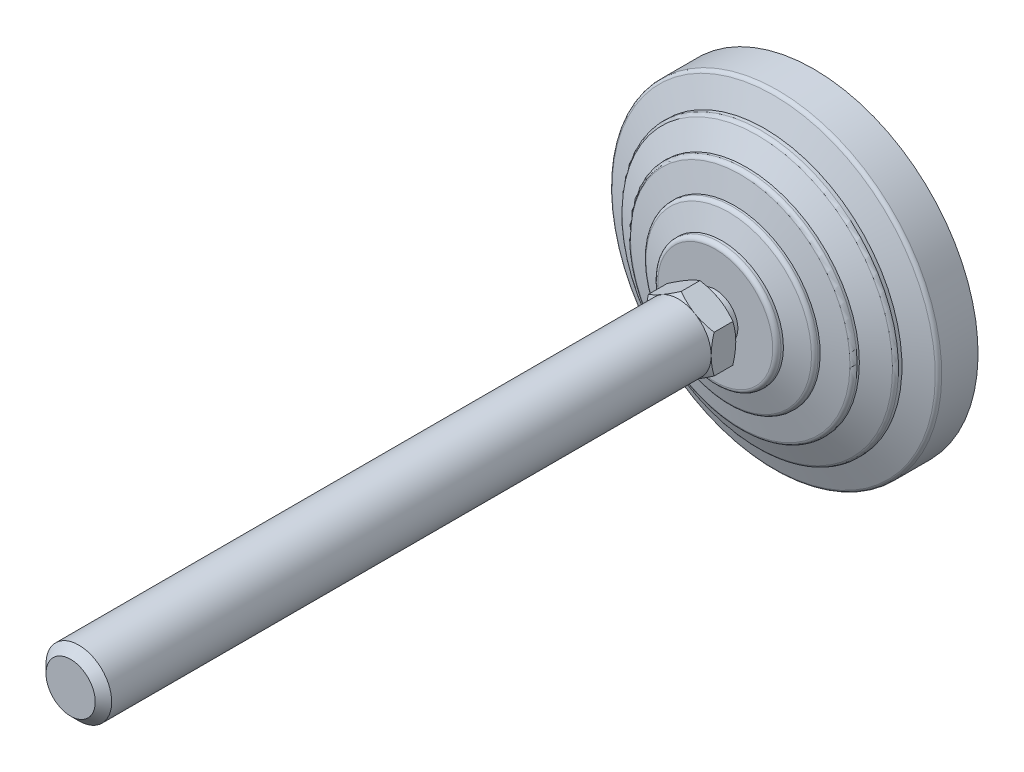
ISO-10303-21;
HEADER;
FILE_DESCRIPTION(('STEP AP214'),'2;1');
FILE_NAME('part.step','',(''),(''),'','','');
FILE_SCHEMA(('AUTOMOTIVE_DESIGN { 1 0 10303 214 1 1 1 1 }'));
ENDSEC;
DATA;
#1=APPLICATION_CONTEXT('core data for automotive mechanical design processes');
#2=APPLICATION_PROTOCOL_DEFINITION('international standard','automotive_design',2000,#1);
#3=PRODUCT_CONTEXT('',#1,'mechanical');
#4=PRODUCT('Part','Part','',(#3));
#5=PRODUCT_RELATED_PRODUCT_CATEGORY('part','',(#4));
#6=PRODUCT_DEFINITION_FORMATION('','',#4);
#7=PRODUCT_DEFINITION_CONTEXT('part definition',#1,'design');
#8=PRODUCT_DEFINITION('design','',#6,#7);
#9=PRODUCT_DEFINITION_SHAPE('','',#8);
#10=(LENGTH_UNIT() NAMED_UNIT(*) SI_UNIT(.MILLI.,.METRE.));
#11=(NAMED_UNIT(*) PLANE_ANGLE_UNIT() SI_UNIT($,.RADIAN.));
#12=(NAMED_UNIT(*) SI_UNIT($,.STERADIAN.) SOLID_ANGLE_UNIT());
#13=UNCERTAINTY_MEASURE_WITH_UNIT(LENGTH_MEASURE(1.E-05),#10,'distance_accuracy_value','');
#14=(GEOMETRIC_REPRESENTATION_CONTEXT(3) GLOBAL_UNCERTAINTY_ASSIGNED_CONTEXT((#13)) GLOBAL_UNIT_ASSIGNED_CONTEXT((#10,
#11,#12)) REPRESENTATION_CONTEXT('',''));
#15=CARTESIAN_POINT('',(0.,0.,0.));
#16=DIRECTION('',(0.,0.,1.));
#17=DIRECTION('',(1.,0.,0.));
#18=AXIS2_PLACEMENT_3D('',#15,#16,#17);
#19=CARTESIAN_POINT('',(-7.76470588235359,0.,30.));
#20=DIRECTION('',(0.,0.,1.));
#21=DIRECTION('',(0.,-1.,0.));
#22=AXIS2_PLACEMENT_3D('',#19,#20,#21);
#23=PLANE('',#22);
#24=CARTESIAN_POINT('',(0.,0.,30.));
#25=DIRECTION('',(0.,0.,-1.));
#26=DIRECTION('',(0.,1.,0.));
#27=AXIS2_PLACEMENT_3D('',#24,#25,#26);
#28=CIRCLE('',#27,5.50000000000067);
#29=CARTESIAN_POINT('',(0.,5.50000000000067,30.));
#30=VERTEX_POINT('',#29);
#31=EDGE_CURVE('E338',#30,#30,#28,.T.);
#32=ORIENTED_EDGE('',*,*,#31,.F.);
#33=EDGE_LOOP('',(#32));
#34=FACE_BOUND('',#33,.T.);
#35=CARTESIAN_POINT('',(0.,0.,30.));
#36=DIRECTION('',(0.,0.,-1.));
#37=DIRECTION('',(-1.,0.,0.));
#38=AXIS2_PLACEMENT_3D('',#35,#36,#37);
#39=CIRCLE('',#38,8.00000000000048);
#40=CARTESIAN_POINT('',(4.,6.92820323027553,30.));
#41=VERTEX_POINT('',#40);
#42=CARTESIAN_POINT('',(8.,0.,30.));
#43=VERTEX_POINT('',#42);
#44=EDGE_CURVE('E491',#41,#43,#39,.T.);
#45=ORIENTED_EDGE('',*,*,#44,.T.);
#46=CARTESIAN_POINT('',(4.,-6.92820323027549,30.));
#47=VERTEX_POINT('',#46);
#48=EDGE_CURVE('E140',#43,#47,#39,.T.);
#49=ORIENTED_EDGE('',*,*,#48,.T.);
#50=CARTESIAN_POINT('',(-4.,-6.92820323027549,30.));
#51=VERTEX_POINT('',#50);
#52=EDGE_CURVE('E139',#47,#51,#39,.T.);
#53=ORIENTED_EDGE('',*,*,#52,.T.);
#54=CARTESIAN_POINT('',(-8.,0.,30.));
#55=VERTEX_POINT('',#54);
#56=EDGE_CURVE('E117',#51,#55,#39,.T.);
#57=ORIENTED_EDGE('',*,*,#56,.T.);
#58=CARTESIAN_POINT('',(-4.,6.92820323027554,30.));
#59=VERTEX_POINT('',#58);
#60=EDGE_CURVE('E105',#55,#59,#39,.T.);
#61=ORIENTED_EDGE('',*,*,#60,.T.);
#62=EDGE_CURVE('E34',#59,#41,#39,.T.);
#63=ORIENTED_EDGE('',*,*,#62,.T.);
#64=EDGE_LOOP('',(#45,#49,#53,#57,#61,#63));
#65=FACE_BOUND('',#64,.T.);
#66=ADVANCED_FACE('F14',(#34,#65),#23,.F.);
#67=CARTESIAN_POINT('',(0.,0.,0.));
#68=DIRECTION('',(0.,0.,-1.));
#69=DIRECTION('',(0.,1.,0.));
#70=AXIS2_PLACEMENT_3D('',#67,#68,#69);
#71=CYLINDRICAL_SURFACE('',#70,5.50000000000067);
#72=CARTESIAN_POINT('',(0.,0.,27.));
#73=DIRECTION('',(0.,0.,-1.));
#74=DIRECTION('',(0.,1.,0.));
#75=AXIS2_PLACEMENT_3D('',#72,#73,#74);
#76=CIRCLE('',#75,5.50000000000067);
#77=CARTESIAN_POINT('',(0.,5.50000000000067,27.));
#78=VERTEX_POINT('',#77);
#79=EDGE_CURVE('E343',#78,#78,#76,.T.);
#80=ORIENTED_EDGE('',*,*,#79,.F.);
#81=EDGE_LOOP('',(#80));
#82=FACE_BOUND('',#81,.T.);
#83=ORIENTED_EDGE('',*,*,#31,.T.);
#84=EDGE_LOOP('',(#83));
#85=FACE_BOUND('',#84,.T.);
#86=ADVANCED_FACE('F305',(#82,#85),#71,.T.);
#87=CARTESIAN_POINT('',(-5.50000000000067,0.,27.));
#88=DIRECTION('',(0.,0.,-1.));
#89=DIRECTION('',(0.,1.,0.));
#90=AXIS2_PLACEMENT_3D('',#87,#88,#89);
#91=PLANE('',#90);
#92=CARTESIAN_POINT('',(0.,0.,27.));
#93=DIRECTION('',(0.,0.,-1.));
#94=DIRECTION('',(0.,1.,0.));
#95=AXIS2_PLACEMENT_3D('',#92,#93,#94);
#96=CIRCLE('',#95,14.);
#97=CARTESIAN_POINT('',(0.,14.,27.));
#98=VERTEX_POINT('',#97);
#99=EDGE_CURVE('E346',#98,#98,#96,.T.);
#100=ORIENTED_EDGE('',*,*,#99,.F.);
#101=EDGE_LOOP('',(#100));
#102=FACE_BOUND('',#101,.T.);
#103=ORIENTED_EDGE('',*,*,#79,.T.);
#104=EDGE_LOOP('',(#103));
#105=FACE_BOUND('',#104,.T.);
#106=ADVANCED_FACE('F301',(#102,#105),#91,.F.);
#107=CARTESIAN_POINT('',(0.,0.,26.));
#108=DIRECTION('',(0.,0.,-1.));
#109=DIRECTION('',(0.,1.,0.));
#110=AXIS2_PLACEMENT_3D('',#107,#108,#109);
#111=TOROIDAL_SURFACE('',#110,14.,1.);
#112=CARTESIAN_POINT('',(0.,0.,26.));
#113=DIRECTION('',(0.,0.,-1.));
#114=DIRECTION('',(0.,1.,0.));
#115=AXIS2_PLACEMENT_3D('',#112,#113,#114);
#116=CIRCLE('',#115,15.);
#117=CARTESIAN_POINT('',(0.,15.,26.));
#118=VERTEX_POINT('',#117);
#119=EDGE_CURVE('E349',#118,#118,#116,.T.);
#120=ORIENTED_EDGE('',*,*,#119,.F.);
#121=EDGE_LOOP('',(#120));
#122=FACE_BOUND('',#121,.T.);
#123=ORIENTED_EDGE('',*,*,#99,.T.);
#124=EDGE_LOOP('',(#123));
#125=FACE_BOUND('',#124,.T.);
#126=ADVANCED_FACE('F297',(#122,#125),#111,.T.);
#127=CARTESIAN_POINT('',(0.,0.,0.));
#128=DIRECTION('',(0.,0.,-1.));
#129=DIRECTION('',(0.,1.,0.));
#130=AXIS2_PLACEMENT_3D('',#127,#128,#129);
#131=CYLINDRICAL_SURFACE('',#130,15.);
#132=CARTESIAN_POINT('',(0.,0.,25.4025287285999));
#133=DIRECTION('',(0.,0.,-1.));
#134=DIRECTION('',(0.,1.,0.));
#135=AXIS2_PLACEMENT_3D('',#132,#133,#134);
#136=CIRCLE('',#135,15.);
#137=CARTESIAN_POINT('',(0.,15.,25.4025287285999));
#138=VERTEX_POINT('',#137);
#139=EDGE_CURVE('E352',#138,#138,#136,.T.);
#140=ORIENTED_EDGE('',*,*,#139,.F.);
#141=EDGE_LOOP('',(#140));
#142=FACE_BOUND('',#141,.T.);
#143=ORIENTED_EDGE('',*,*,#119,.T.);
#144=EDGE_LOOP('',(#143));
#145=FACE_BOUND('',#144,.T.);
#146=ADVANCED_FACE('F293',(#142,#145),#131,.T.);
#147=CARTESIAN_POINT('',(0.,0.,25.4025287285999));
#148=DIRECTION('',(0.,0.,-1.));
#149=DIRECTION('',(0.,1.,0.));
#150=AXIS2_PLACEMENT_3D('',#147,#148,#149);
#151=CONICAL_SURFACE('',#150,15.,1.25589726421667);
#152=CARTESIAN_POINT('',(0.,0.,23.7216684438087));
#153=DIRECTION('',(0.,0.,-1.));
#154=DIRECTION('',(0.,1.,0.));
#155=AXIS2_PLACEMENT_3D('',#152,#153,#154);
#156=CIRCLE('',#155,20.1601635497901);
#157=CARTESIAN_POINT('',(0.,20.1601635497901,23.7216684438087));
#158=VERTEX_POINT('',#157);
#159=EDGE_CURVE('E355',#158,#158,#156,.T.);
#160=ORIENTED_EDGE('',*,*,#159,.F.);
#161=EDGE_LOOP('',(#160));
#162=FACE_BOUND('',#161,.T.);
#163=ORIENTED_EDGE('',*,*,#139,.T.);
#164=EDGE_LOOP('',(#163));
#165=FACE_BOUND('',#164,.T.);
#166=ADVANCED_FACE('F289',(#162,#165),#151,.T.);
#167=CARTESIAN_POINT('',(0.,0.,22.7708407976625));
#168=DIRECTION('',(0.,0.,-1.));
#169=DIRECTION('',(0.,1.,0.));
#170=AXIS2_PLACEMENT_3D('',#167,#168,#169);
#171=TOROIDAL_SURFACE('',#170,19.8504430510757,1.);
#172=CARTESIAN_POINT('',(0.,0.,22.7708407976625));
#173=DIRECTION('',(0.,0.,-1.));
#174=DIRECTION('',(0.,1.,0.));
#175=AXIS2_PLACEMENT_3D('',#172,#173,#174);
#176=CIRCLE('',#175,20.8504430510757);
#177=CARTESIAN_POINT('',(0.,20.8504430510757,22.7708407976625));
#178=VERTEX_POINT('',#177);
#179=EDGE_CURVE('E358',#178,#178,#176,.T.);
#180=ORIENTED_EDGE('',*,*,#179,.F.);
#181=EDGE_LOOP('',(#180));
#182=FACE_BOUND('',#181,.T.);
#183=ORIENTED_EDGE('',*,*,#159,.T.);
#184=EDGE_LOOP('',(#183));
#185=FACE_BOUND('',#184,.T.);
#186=ADVANCED_FACE('F285',(#182,#185),#171,.T.);
#187=CARTESIAN_POINT('',(0.,0.,0.));
#188=DIRECTION('',(0.,0.,-1.));
#189=DIRECTION('',(0.,1.,0.));
#190=AXIS2_PLACEMENT_3D('',#187,#188,#189);
#191=CYLINDRICAL_SURFACE('',#190,20.8504430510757);
#192=CARTESIAN_POINT('',(0.,0.,22.2987385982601));
#193=DIRECTION('',(0.,0.,-1.));
#194=DIRECTION('',(0.,1.,0.));
#195=AXIS2_PLACEMENT_3D('',#192,#193,#194);
#196=CIRCLE('',#195,20.8504430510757);
#197=CARTESIAN_POINT('',(0.,20.8504430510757,22.2987385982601));
#198=VERTEX_POINT('',#197);
#199=EDGE_CURVE('E361',#198,#198,#196,.T.);
#200=ORIENTED_EDGE('',*,*,#199,.F.);
#201=EDGE_LOOP('',(#200));
#202=FACE_BOUND('',#201,.T.);
#203=ORIENTED_EDGE('',*,*,#179,.T.);
#204=EDGE_LOOP('',(#203));
#205=FACE_BOUND('',#204,.T.);
#206=ADVANCED_FACE('F281',(#202,#205),#191,.T.);
#207=CARTESIAN_POINT('',(0.,0.,22.2987385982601));
#208=DIRECTION('',(0.,0.,-1.));
#209=DIRECTION('',(0.,1.,0.));
#210=AXIS2_PLACEMENT_3D('',#207,#208,#209);
#211=CONICAL_SURFACE('',#210,20.8504430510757,1.34067144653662);
#212=CARTESIAN_POINT('',(0.,0.,20.9217501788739));
#213=DIRECTION('',(0.,0.,-1.));
#214=DIRECTION('',(0.,1.,0.));
#215=AXIS2_PLACEMENT_3D('',#212,#213,#214);
#216=CIRCLE('',#215,26.7280991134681);
#217=CARTESIAN_POINT('',(0.,26.7280991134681,20.9217501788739));
#218=VERTEX_POINT('',#217);
#219=EDGE_CURVE('E364',#218,#218,#216,.T.);
#220=ORIENTED_EDGE('',*,*,#219,.F.);
#221=EDGE_LOOP('',(#220));
#222=FACE_BOUND('',#221,.T.);
#223=ORIENTED_EDGE('',*,*,#199,.T.);
#224=EDGE_LOOP('',(#223));
#225=FACE_BOUND('',#224,.T.);
#226=ADVANCED_FACE('F277',(#222,#225),#211,.T.);
#227=CARTESIAN_POINT('',(0.,0.,19.9481122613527));
#228=DIRECTION('',(0.,0.,-1.));
#229=DIRECTION('',(0.,1.,0.));
#230=AXIS2_PLACEMENT_3D('',#227,#228,#229);
#231=TOROIDAL_SURFACE('',#230,26.5,1.);
#232=CARTESIAN_POINT('',(0.,0.,19.9481122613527));
#233=DIRECTION('',(0.,0.,-1.));
#234=DIRECTION('',(0.,1.,0.));
#235=AXIS2_PLACEMENT_3D('',#232,#233,#234);
#236=CIRCLE('',#235,27.5);
#237=CARTESIAN_POINT('',(0.,27.5,19.9481122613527));
#238=VERTEX_POINT('',#237);
#239=EDGE_CURVE('E367',#238,#238,#236,.T.);
#240=ORIENTED_EDGE('',*,*,#239,.F.);
#241=EDGE_LOOP('',(#240));
#242=FACE_BOUND('',#241,.T.);
#243=ORIENTED_EDGE('',*,*,#219,.T.);
#244=EDGE_LOOP('',(#243));
#245=FACE_BOUND('',#244,.T.);
#246=ADVANCED_FACE('F273',(#242,#245),#231,.T.);
#247=CARTESIAN_POINT('',(0.,0.,0.));
#248=DIRECTION('',(0.,0.,-1.));
#249=DIRECTION('',(0.,1.,0.));
#250=AXIS2_PLACEMENT_3D('',#247,#248,#249);
#251=CYLINDRICAL_SURFACE('',#250,27.5);
#252=CARTESIAN_POINT('',(0.,0.,19.4025287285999));
#253=DIRECTION('',(0.,0.,-1.));
#254=DIRECTION('',(0.,1.,0.));
#255=AXIS2_PLACEMENT_3D('',#252,#253,#254);
#256=CIRCLE('',#255,27.5);
#257=CARTESIAN_POINT('',(0.,27.5,19.4025287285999));
#258=VERTEX_POINT('',#257);
#259=EDGE_CURVE('E370',#258,#258,#256,.T.);
#260=ORIENTED_EDGE('',*,*,#259,.F.);
#261=EDGE_LOOP('',(#260));
#262=FACE_BOUND('',#261,.T.);
#263=ORIENTED_EDGE('',*,*,#239,.T.);
#264=EDGE_LOOP('',(#263));
#265=FACE_BOUND('',#264,.T.);
#266=ADVANCED_FACE('F269',(#262,#265),#251,.T.);
#267=CARTESIAN_POINT('',(0.,0.,19.4025287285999));
#268=DIRECTION('',(0.,0.,-1.));
#269=DIRECTION('',(0.,1.,0.));
#270=AXIS2_PLACEMENT_3D('',#267,#268,#269);
#271=CONICAL_SURFACE('',#270,27.5,1.12022914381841);
#272=CARTESIAN_POINT('',(0.,0.,16.7730910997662));
#273=DIRECTION('',(0.,0.,-1.));
#274=DIRECTION('',(0.,1.,0.));
#275=AXIS2_PLACEMENT_3D('',#272,#273,#274);
#276=CIRCLE('',#275,32.9354761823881);
#277=CARTESIAN_POINT('',(0.,32.9354761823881,16.7730910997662));
#278=VERTEX_POINT('',#277);
#279=EDGE_CURVE('E373',#278,#278,#276,.T.);
#280=ORIENTED_EDGE('',*,*,#279,.F.);
#281=EDGE_LOOP('',(#280));
#282=FACE_BOUND('',#281,.T.);
#283=ORIENTED_EDGE('',*,*,#259,.T.);
#284=EDGE_LOOP('',(#283));
#285=FACE_BOUND('',#284,.T.);
#286=ADVANCED_FACE('F265',(#282,#285),#271,.T.);
#287=CARTESIAN_POINT('',(0.,0.,15.8728908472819));
#288=DIRECTION('',(0.,0.,-1.));
#289=DIRECTION('',(0.,1.,0.));
#290=AXIS2_PLACEMENT_3D('',#287,#288,#289);
#291=TOROIDAL_SURFACE('',#290,32.5,1.);
#292=CARTESIAN_POINT('',(0.,0.,15.8728908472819));
#293=DIRECTION('',(0.,0.,-1.));
#294=DIRECTION('',(0.,1.,0.));
#295=AXIS2_PLACEMENT_3D('',#292,#293,#294);
#296=CIRCLE('',#295,33.5);
#297=CARTESIAN_POINT('',(0.,33.5,15.8728908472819));
#298=VERTEX_POINT('',#297);
#299=EDGE_CURVE('E376',#298,#298,#296,.T.);
#300=ORIENTED_EDGE('',*,*,#299,.F.);
#301=EDGE_LOOP('',(#300));
#302=FACE_BOUND('',#301,.T.);
#303=ORIENTED_EDGE('',*,*,#279,.T.);
#304=EDGE_LOOP('',(#303));
#305=FACE_BOUND('',#304,.T.);
#306=ADVANCED_FACE('F261',(#302,#305),#291,.T.);
#307=CARTESIAN_POINT('',(0.,0.,0.));
#308=DIRECTION('',(0.,0.,-1.));
#309=DIRECTION('',(0.,1.,0.));
#310=AXIS2_PLACEMENT_3D('',#307,#308,#309);
#311=CYLINDRICAL_SURFACE('',#310,33.5);
#312=CARTESIAN_POINT('',(0.,0.,15.0315037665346));
#313=DIRECTION('',(0.,0.,-1.));
#314=DIRECTION('',(0.,1.,0.));
#315=AXIS2_PLACEMENT_3D('',#312,#313,#314);
#316=CIRCLE('',#315,33.5);
#317=CARTESIAN_POINT('',(0.,33.5,15.0315037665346));
#318=VERTEX_POINT('',#317);
#319=EDGE_CURVE('E379',#318,#318,#316,.T.);
#320=ORIENTED_EDGE('',*,*,#319,.F.);
#321=EDGE_LOOP('',(#320));
#322=FACE_BOUND('',#321,.T.);
#323=ORIENTED_EDGE('',*,*,#299,.T.);
#324=EDGE_LOOP('',(#323));
#325=FACE_BOUND('',#324,.T.);
#326=ADVANCED_FACE('F257',(#322,#325),#311,.T.);
#327=CARTESIAN_POINT('',(0.,0.,15.0315037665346));
#328=DIRECTION('',(0.,0.,-1.));
#329=DIRECTION('',(0.,1.,0.));
#330=AXIS2_PLACEMENT_3D('',#327,#328,#329);
#331=CONICAL_SURFACE('',#330,33.5,1.20362249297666);
#332=CARTESIAN_POINT('',(0.,0.,12.7780502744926));
#333=DIRECTION('',(0.,0.,-1.));
#334=DIRECTION('',(0.,1.,0.));
#335=AXIS2_PLACEMENT_3D('',#332,#333,#334);
#336=CIRCLE('',#335,39.3589790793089);
#337=CARTESIAN_POINT('',(0.,39.3589790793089,12.7780502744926));
#338=VERTEX_POINT('',#337);
#339=EDGE_CURVE('E382',#338,#338,#336,.T.);
#340=ORIENTED_EDGE('',*,*,#339,.F.);
#341=EDGE_LOOP('',(#340));
#342=FACE_BOUND('',#341,.T.);
#343=ORIENTED_EDGE('',*,*,#319,.T.);
#344=EDGE_LOOP('',(#343));
#345=FACE_BOUND('',#344,.T.);
#346=ADVANCED_FACE('F253',(#342,#345),#331,.T.);
#347=CARTESIAN_POINT('',(0.,0.,11.8447046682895));
#348=DIRECTION('',(0.,0.,-1.));
#349=DIRECTION('',(0.,1.,0.));
#350=AXIS2_PLACEMENT_3D('',#347,#348,#349);
#351=TOROIDAL_SURFACE('',#350,39.,1.);
#352=CARTESIAN_POINT('',(0.,0.,11.8447046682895));
#353=DIRECTION('',(0.,0.,-1.));
#354=DIRECTION('',(0.,1.,0.));
#355=AXIS2_PLACEMENT_3D('',#352,#353,#354);
#356=CIRCLE('',#355,40.);
#357=CARTESIAN_POINT('',(0.,40.,11.8447046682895));
#358=VERTEX_POINT('',#357);
#359=EDGE_CURVE('E385',#358,#358,#356,.T.);
#360=ORIENTED_EDGE('',*,*,#359,.F.);
#361=EDGE_LOOP('',(#360));
#362=FACE_BOUND('',#361,.T.);
#363=ORIENTED_EDGE('',*,*,#339,.T.);
#364=EDGE_LOOP('',(#363));
#365=FACE_BOUND('',#364,.T.);
#366=ADVANCED_FACE('F249',(#362,#365),#351,.T.);
#367=CARTESIAN_POINT('',(0.,0.,0.));
#368=DIRECTION('',(0.,0.,-1.));
#369=DIRECTION('',(0.,1.,0.));
#370=AXIS2_PLACEMENT_3D('',#367,#368,#369);
#371=CYLINDRICAL_SURFACE('',#370,40.);
#372=CARTESIAN_POINT('',(0.,0.,3.));
#373=DIRECTION('',(0.,0.,-1.));
#374=DIRECTION('',(0.,1.,0.));
#375=AXIS2_PLACEMENT_3D('',#372,#373,#374);
#376=CIRCLE('',#375,40.);
#377=CARTESIAN_POINT('',(0.,40.,3.));
#378=VERTEX_POINT('',#377);
#379=EDGE_CURVE('E388',#378,#378,#376,.T.);
#380=ORIENTED_EDGE('',*,*,#379,.F.);
#381=EDGE_LOOP('',(#380));
#382=FACE_BOUND('',#381,.T.);
#383=ORIENTED_EDGE('',*,*,#359,.T.);
#384=EDGE_LOOP('',(#383));
#385=FACE_BOUND('',#384,.T.);
#386=ADVANCED_FACE('F245',(#382,#385),#371,.T.);
#387=CARTESIAN_POINT('',(-33.5,0.,3.));
#388=DIRECTION('',(0.,0.,1.));
#389=DIRECTION('',(0.,-1.,0.));
#390=AXIS2_PLACEMENT_3D('',#387,#388,#389);
#391=PLANE('',#390);
#392=CARTESIAN_POINT('',(0.,0.,3.));
#393=DIRECTION('',(0.,0.,-1.));
#394=DIRECTION('',(0.,1.,0.));
#395=AXIS2_PLACEMENT_3D('',#392,#393,#394);
#396=CIRCLE('',#395,33.5);
#397=CARTESIAN_POINT('',(0.,33.5,3.));
#398=VERTEX_POINT('',#397);
#399=EDGE_CURVE('E391',#398,#398,#396,.T.);
#400=ORIENTED_EDGE('',*,*,#399,.F.);
#401=EDGE_LOOP('',(#400));
#402=FACE_BOUND('',#401,.T.);
#403=ORIENTED_EDGE('',*,*,#379,.T.);
#404=EDGE_LOOP('',(#403));
#405=FACE_BOUND('',#404,.T.);
#406=ADVANCED_FACE('F241',(#402,#405),#391,.F.);
#407=CARTESIAN_POINT('',(0.,0.,0.));
#408=DIRECTION('',(0.,0.,-1.));
#409=DIRECTION('',(0.,1.,0.));
#410=AXIS2_PLACEMENT_3D('',#407,#408,#409);
#411=CYLINDRICAL_SURFACE('',#410,33.5);
#412=CARTESIAN_POINT('',(0.,0.,0.));
#413=DIRECTION('',(0.,0.,-1.));
#414=DIRECTION('',(0.,1.,0.));
#415=AXIS2_PLACEMENT_3D('',#412,#413,#414);
#416=CIRCLE('',#415,33.5);
#417=CARTESIAN_POINT('',(0.,33.5,0.));
#418=VERTEX_POINT('',#417);
#419=EDGE_CURVE('E394',#418,#418,#416,.T.);
#420=ORIENTED_EDGE('',*,*,#419,.F.);
#421=EDGE_LOOP('',(#420));
#422=FACE_BOUND('',#421,.T.);
#423=ORIENTED_EDGE('',*,*,#399,.T.);
#424=EDGE_LOOP('',(#423));
#425=FACE_BOUND('',#424,.T.);
#426=ADVANCED_FACE('F237',(#422,#425),#411,.T.);
#427=CARTESIAN_POINT('',(0.,0.,0.));
#428=DIRECTION('',(0.,0.,1.));
#429=DIRECTION('',(0.,-1.,0.));
#430=AXIS2_PLACEMENT_3D('',#427,#428,#429);
#431=PLANE('',#430);
#432=ORIENTED_EDGE('',*,*,#419,.T.);
#433=EDGE_LOOP('',(#432));
#434=FACE_BOUND('',#433,.T.);
#435=ADVANCED_FACE('F233',(#434),#431,.F.);
#436=CARTESIAN_POINT('',(0.,0.,31.1758443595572));
#437=DIRECTION('',(0.,0.,1.));
#438=DIRECTION('',(1.,0.,0.));
#439=AXIS2_PLACEMENT_3D('',#436,#437,#438);
#440=CONICAL_SURFACE('',#439,10.0366221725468,1.0471975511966);
#441=CARTESIAN_POINT('',(8.,-12.3138448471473,33.8592238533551));
#442=CARTESIAN_POINT('',(8.,-11.9652029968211,33.690476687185));
#443=CARTESIAN_POINT('',(7.99999999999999,-11.6157507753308,33.5233746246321));
#444=CARTESIAN_POINT('',(7.99999999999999,-10.914794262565,33.1933878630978));
#445=CARTESIAN_POINT('',(7.99999999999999,-10.5632896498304,33.0305038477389));
#446=CARTESIAN_POINT('',(7.99999999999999,-9.85594095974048,32.709040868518));
#447=CARTESIAN_POINT('',(7.99999999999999,-9.50008361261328,32.5504910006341));
#448=CARTESIAN_POINT('',(7.99999999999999,-8.7855059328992,32.240004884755));
#449=CARTESIAN_POINT('',(7.99999999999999,-8.42678573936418,32.0880683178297));
#450=CARTESIAN_POINT('',(7.99999999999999,-7.6946902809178,31.7879579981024));
#451=CARTESIAN_POINT('',(7.99999999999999,-7.32120619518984,31.6400482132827));
#452=CARTESIAN_POINT('',(7.99999999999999,-6.56983523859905,31.3556494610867));
#453=CARTESIAN_POINT('',(8.,-6.191947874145,31.2191617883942));
#454=CARTESIAN_POINT('',(8.,-5.43190247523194,30.9612590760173));
#455=CARTESIAN_POINT('',(7.99999999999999,-5.04975519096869,30.8398127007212));
#456=CARTESIAN_POINT('',(8.,-4.27999415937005,30.6159488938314));
#457=CARTESIAN_POINT('',(8.,-3.89238220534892,30.5135253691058));
#458=CARTESIAN_POINT('',(8.,-3.11354348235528,30.3332309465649));
#459=CARTESIAN_POINT('',(8.,-2.7223476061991,30.2552302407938));
#460=CARTESIAN_POINT('',(8.,-2.13206688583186,30.1599682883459));
#461=CARTESIAN_POINT('',(8.,-1.93471024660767,30.1318361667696));
#462=CARTESIAN_POINT('',(8.,-1.53904791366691,30.0833720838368));
#463=CARTESIAN_POINT('',(8.,-1.34074231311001,30.0630393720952));
#464=CARTESIAN_POINT('',(8.,-0.94599684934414,30.0308294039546));
#465=CARTESIAN_POINT('',(8.,-0.749565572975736,30.018847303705));
#466=CARTESIAN_POINT('',(8.,-0.356372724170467,30.0031938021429));
#467=CARTESIAN_POINT('',(8.,-0.1596111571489,29.9995222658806));
#468=CARTESIAN_POINT('',(8.,0.233891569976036,30.0005772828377));
#469=CARTESIAN_POINT('',(8.,0.430632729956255,30.0053038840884));
#470=CARTESIAN_POINT('',(8.,0.823743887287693,30.0230413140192));
#471=CARTESIAN_POINT('',(8.,1.0201138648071,30.0360525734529));
#472=CARTESIAN_POINT('',(8.,1.49491212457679,30.077255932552));
#473=CARTESIAN_POINT('',(8.,1.7729927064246,30.109537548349));
#474=CARTESIAN_POINT('',(8.,2.32701524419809,30.1889311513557));
#475=CARTESIAN_POINT('',(8.,2.60295689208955,30.2360452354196));
#476=CARTESIAN_POINT('',(8.,3.42730071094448,30.3971314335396));
#477=CARTESIAN_POINT('',(8.,3.97189769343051,30.5308157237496));
#478=CARTESIAN_POINT('',(8.,4.78607468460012,30.7616864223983));
#479=CARTESIAN_POINT('',(8.,5.05990161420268,30.8447492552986));
#480=CARTESIAN_POINT('',(8.,5.60489452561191,31.0192660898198));
#481=CARTESIAN_POINT('',(8.,5.87606049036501,31.1107201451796));
#482=CARTESIAN_POINT('',(8.,6.41582119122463,31.3005718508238));
#483=CARTESIAN_POINT('',(8.,6.68441679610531,31.3989670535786));
#484=CARTESIAN_POINT('',(8.,7.21939887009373,31.6015669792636));
#485=CARTESIAN_POINT('',(8.,7.4857853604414,31.705771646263));
#486=CARTESIAN_POINT('',(8.,8.09450128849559,31.9503198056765));
#487=CARTESIAN_POINT('',(8.,8.43617420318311,32.0922940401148));
#488=CARTESIAN_POINT('',(8.,9.11677263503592,32.3826985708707));
#489=CARTESIAN_POINT('',(8.,9.45569801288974,32.5311291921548));
#490=CARTESIAN_POINT('',(8.,10.1312876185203,32.8332070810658));
#491=CARTESIAN_POINT('',(8.,10.4679514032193,32.9868553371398));
#492=CARTESIAN_POINT('',(8.,11.1393146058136,33.2983616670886));
#493=CARTESIAN_POINT('',(8.,11.4740140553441,33.4562196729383));
#494=CARTESIAN_POINT('',(8.,12.142062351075,33.7755320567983));
#495=CARTESIAN_POINT('',(8.,12.4754097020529,33.9369895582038));
#496=CARTESIAN_POINT('',(8.,13.1407015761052,34.2627717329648));
#497=CARTESIAN_POINT('',(8.,13.4726460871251,34.4270964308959));
#498=CARTESIAN_POINT('',(8.,14.4667124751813,34.9236434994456));
#499=CARTESIAN_POINT('',(8.,15.1270536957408,35.2594323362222));
#500=CARTESIAN_POINT('',(8.,16.0889289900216,35.7548040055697));
#501=CARTESIAN_POINT('',(8.00000000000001,16.3918460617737,35.911718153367));
#502=CARTESIAN_POINT('',(8.00000000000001,16.9970195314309,36.2268039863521));
#503=CARTESIAN_POINT('',(8.00000000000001,17.2992759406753,36.3849756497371));
#504=CARTESIAN_POINT('',(8.00000000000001,18.2052077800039,36.8611375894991));
#505=CARTESIAN_POINT('',(8.00000000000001,18.808023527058,37.1807633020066));
#506=CARTESIAN_POINT('',(8.00000000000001,20.0105086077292,37.822633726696));
#507=CARTESIAN_POINT('',(8.00000000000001,20.610181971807,38.1448709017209));
#508=CARTESIAN_POINT('',(8.00000000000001,21.8080630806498,38.791987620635));
#509=CARTESIAN_POINT('',(8.00000000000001,22.4062708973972,39.1168670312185));
#510=CARTESIAN_POINT('',(8.,23.0039332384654,39.4427404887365));
#511=B_SPLINE_CURVE_WITH_KNOTS('',3,(#441,#442,#443,#444,#445,#446,#447,#448,#449,#450,#451,
#452,#453,#454,#455,#456,#457,#458,#459,#460,#461,#462,#463,#464,#465,#466,#467,#468,#469,#470,
#471,#472,#473,#474,#475,#476,#477,#478,#479,#480,#481,#482,#483,#484,#485,#486,#487,#488,#489,
#490,#491,#492,#493,#494,#495,#496,#497,#498,#499,#500,#501,#502,#503,#504,#505,#506,#507,#508,
#509,#510),.UNSPECIFIED.,.F.,.F.,(4,2,2,2,2,2,2,2,2,2,2,2,2,2,2,2,2,2,2,2,2,2,2,2,2,2,2,2,2,2,2,
2,2,2,4),(0.,1.16201323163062,2.32421362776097,3.49289951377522,4.66152897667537,
5.86650192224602,7.07161126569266,8.27416618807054,9.47633525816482,10.6720018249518,
11.2699266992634,11.8677940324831,12.4580127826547,13.0482219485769,13.6384344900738,
14.2286777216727,15.0680455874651,15.9075321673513,17.5874778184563,18.4458530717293,
19.3042338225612,20.162313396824,21.0203847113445,22.1302855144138,23.2402422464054,
24.3504104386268,25.4605607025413,26.5717149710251,27.6828787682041,29.9052513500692,
30.9286892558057,31.9521094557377,33.9990251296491,36.0413219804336,38.0835164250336),.UNSPECIFIED.);
#512=CARTESIAN_POINT('',(8.,4.61880215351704,30.714531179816));
#513=VERTEX_POINT('',#512);
#514=EDGE_CURVE('E115',#513,#43,#511,.F.);
#515=ORIENTED_EDGE('',*,*,#514,.T.);
#516=ORIENTED_EDGE('',*,*,#44,.F.);
#517=CARTESIAN_POINT('',(-1.07363400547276,9.85746718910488,31.1060660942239));
#518=CARTESIAN_POINT('',(-0.876968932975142,9.74392255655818,31.0286208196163));
#519=CARTESIAN_POINT('',(-0.679515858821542,9.62992297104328,30.95376048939));
#520=CARTESIAN_POINT('',(-0.282875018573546,9.4009222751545,30.8101391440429));
#521=CARTESIAN_POINT('',(-0.0836866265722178,9.28592080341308,30.7413804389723));
#522=CARTESIAN_POINT('',(0.317268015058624,9.05442953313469,30.6106801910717));
#523=CARTESIAN_POINT('',(0.519041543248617,8.93793553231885,30.5487682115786));
#524=CARTESIAN_POINT('',(0.924342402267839,8.70393497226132,30.4331994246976));
#525=CARTESIAN_POINT('',(1.12786954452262,8.58642852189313,30.3795417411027));
#526=CARTESIAN_POINT('',(1.53029686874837,8.35408699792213,30.283137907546));
#527=CARTESIAN_POINT('',(1.72914526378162,8.23928182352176,30.2401054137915));
#528=CARTESIAN_POINT('',(2.12825009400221,8.00885854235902,30.1638939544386));
#529=CARTESIAN_POINT('',(2.32850642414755,7.89324049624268,30.1307142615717));
#530=CARTESIAN_POINT('',(2.72976896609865,7.6615714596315,30.0751681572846));
#531=CARTESIAN_POINT('',(2.93077306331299,7.54552168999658,30.0527815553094));
#532=CARTESIAN_POINT('',(3.3334916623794,7.31301199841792,30.019412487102));
#533=CARTESIAN_POINT('',(3.53520614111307,7.19655208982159,30.0084296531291));
#534=CARTESIAN_POINT('',(3.92686657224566,6.97042683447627,29.9985253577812));
#535=CARTESIAN_POINT('',(4.11679979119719,6.86076883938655,29.9989261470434));
#536=CARTESIAN_POINT('',(4.49643534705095,6.64158614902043,30.0101159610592));
#537=CARTESIAN_POINT('',(4.68613768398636,6.53206145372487,30.0209049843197));
#538=CARTESIAN_POINT('',(5.06521130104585,6.31320319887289,30.0525885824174));
#539=CARTESIAN_POINT('',(5.25458154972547,6.2038702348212,30.0734994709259));
#540=CARTESIAN_POINT('',(5.63233796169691,5.98577246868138,30.1248629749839));
#541=CARTESIAN_POINT('',(5.82072413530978,5.87700766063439,30.155315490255));
#542=CARTESIAN_POINT('',(6.39511247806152,5.54538439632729,30.2619451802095));
#543=CARTESIAN_POINT('',(6.77912053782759,5.32367723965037,30.352393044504));
#544=CARTESIAN_POINT('',(7.53981508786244,4.88449003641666,30.5628117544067));
#545=CARTESIAN_POINT('',(7.91652080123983,4.66699889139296,30.6826888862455));
#546=CARTESIAN_POINT('',(8.28973579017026,4.45152311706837,30.8136858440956));
#547=B_SPLINE_CURVE_WITH_KNOTS('',3,(#517,#518,#519,#520,#521,#522,#523,#524,#525,#526,#527,
#528,#529,#530,#531,#532,#533,#534,#535,#536,#537,#538,#539,#540,#541,#542,#543,#544,#545,#546),
.UNSPECIFIED.,.F.,.F.,(4,2,2,2,2,2,2,2,2,2,2,2,2,2,4),(0.,0.719820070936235,1.43991151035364,
2.16299989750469,2.8860114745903,3.58664292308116,4.28722264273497,4.98648665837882,
5.68572812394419,6.34343105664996,7.0011338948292,7.65990031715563,8.31865981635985,
9.67503886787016,11.0271534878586),.UNSPECIFIED.);
#548=EDGE_CURVE('E18',#41,#513,#547,.T.);
#549=ORIENTED_EDGE('',*,*,#548,.T.);
#550=EDGE_LOOP('',(#515,#516,#549));
#551=FACE_BOUND('',#550,.T.);
#552=ADVANCED_FACE('F157',(#551),#440,.T.);
#553=CARTESIAN_POINT('',(-14.4129525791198,0.916282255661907,33.7193186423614));
#554=CARTESIAN_POINT('',(-14.1084720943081,1.09207414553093,33.5503724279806));
#555=CARTESIAN_POINT('',(-13.8032449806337,1.26829710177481,33.3831858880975));
#556=CARTESIAN_POINT('',(-13.1908889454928,1.62184102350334,33.0533516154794));
#557=CARTESIAN_POINT('',(-12.8837596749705,1.79916219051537,32.8907047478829));
#558=CARTESIAN_POINT('',(-12.2653757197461,2.15618633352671,32.5700331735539));
#559=CARTESIAN_POINT('',(-11.9541072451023,2.33589727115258,32.4120437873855));
#560=CARTESIAN_POINT('',(-11.3289144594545,2.69685249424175,32.1032627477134));
#561=CARTESIAN_POINT('',(-11.0149902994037,2.87809669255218,31.9524706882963));
#562=CARTESIAN_POINT('',(-10.3812382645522,3.24399360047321,31.6587716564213));
#563=CARTESIAN_POINT('',(-10.0613828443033,3.42866221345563,31.5159434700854));
#564=CARTESIAN_POINT('',(-9.41779346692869,3.80023871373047,31.2422197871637));
#565=CARTESIAN_POINT('',(-9.09405906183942,3.9871468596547,31.1113256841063));
#566=CARTESIAN_POINT('',(-8.4429503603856,4.36306464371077,30.865238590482));
#567=CARTESIAN_POINT('',(-8.1155865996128,4.55206819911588,30.7500088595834));
#568=CARTESIAN_POINT('',(-7.45620338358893,4.93276327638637,30.5392203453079));
#569=CARTESIAN_POINT('',(-7.12418554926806,5.12445386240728,30.4436548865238));
#570=CARTESIAN_POINT('',(-6.45766062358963,5.50927220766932,30.2777010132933));
#571=CARTESIAN_POINT('',(-6.12318513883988,5.70238171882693,30.2071481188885));
#572=CARTESIAN_POINT('',(-5.61875146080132,5.9936166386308,30.1231508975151));
#573=CARTESIAN_POINT('',(-5.4501312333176,6.09096957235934,30.0987887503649));
#574=CARTESIAN_POINT('',(-5.11219049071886,6.28607975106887,30.0578248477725));
#575=CARTESIAN_POINT('',(-4.94287004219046,6.38383695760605,30.0412223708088));
#576=CARTESIAN_POINT('',(-4.60469375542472,6.57908312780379,30.0162126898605));
#577=CARTESIAN_POINT('',(-4.43584035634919,6.67657068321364,30.0077616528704));
#578=CARTESIAN_POINT('',(-4.0979761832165,6.87163665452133,29.9990908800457));
#579=CARTESIAN_POINT('',(-3.92896541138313,6.96921506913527,29.9988710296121));
#580=CARTESIAN_POINT('',(-3.59112847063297,7.16426531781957,30.0066677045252));
#581=CARTESIAN_POINT('',(-3.42230226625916,7.26173717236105,30.0146821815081));
#582=CARTESIAN_POINT('',(-3.08507810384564,7.45643363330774,30.0387585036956));
#583=CARTESIAN_POINT('',(-2.91668017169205,7.55365822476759,30.0548208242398));
#584=CARTESIAN_POINT('',(-2.50025818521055,7.79407957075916,30.1041699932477));
#585=CARTESIAN_POINT('',(-2.25263257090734,7.93704628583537,30.1420198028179));
#586=CARTESIAN_POINT('',(-1.75949511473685,8.22175932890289,30.2329400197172));
#587=CARTESIAN_POINT('',(-1.51398363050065,8.36350545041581,30.2860129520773));
#588=CARTESIAN_POINT('',(-0.780103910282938,8.78721110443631,30.465379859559));
#589=CARTESIAN_POINT('',(-0.295371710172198,9.06707137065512,30.6116914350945));
#590=CARTESIAN_POINT('',(0.42921607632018,9.48541232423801,30.8614258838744));
#591=CARTESIAN_POINT('',(0.672906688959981,9.62610716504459,30.9508351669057));
#592=CARTESIAN_POINT('',(1.15793564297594,9.90613876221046,31.137939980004));
#593=CARTESIAN_POINT('',(1.39927378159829,10.0454754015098,31.2356362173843));
#594=CARTESIAN_POINT('',(1.87838616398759,10.3220910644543,31.4372704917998));
#595=CARTESIAN_POINT('',(2.11617294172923,10.4593773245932,31.5411692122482));
#596=CARTESIAN_POINT('',(2.58976469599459,10.7328056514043,31.7545749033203));
#597=CARTESIAN_POINT('',(2.82557030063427,10.8689480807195,31.8640800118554));
#598=CARTESIAN_POINT('',(3.06054826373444,11.004612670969,31.9758536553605));
#599=B_SPLINE_CURVE_WITH_KNOTS('',3,(#553,#554,#555,#556,#557,#558,#559,#560,#561,#562,#563,
#564,#565,#566,#567,#568,#569,#570,#571,#572,#573,#574,#575,#576,#577,#578,#579,#580,#581,#582,
#583,#584,#585,#586,#587,#588,#589,#590,#591,#592,#593,#594,#595,#596,#597,#598),.UNSPECIFIED.,
.F.,.F.,(4,2,2,2,2,2,2,2,2,2,2,2,2,2,2,2,2,2,2,2,2,2,4),(0.,1.17022499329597,2.34067149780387,
3.51844712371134,4.69615624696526,5.88397363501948,7.07192954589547,8.25704920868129,
9.44176589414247,10.6185408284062,11.2070824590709,11.7955693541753,12.3808738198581,
12.9661701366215,13.5513208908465,14.1365062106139,15.0012913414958,15.8662199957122,
17.5994841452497,18.4851822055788,19.370955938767,20.2516128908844,21.1319792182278),.UNSPECIFIED.);
#600=CARTESIAN_POINT('',(0.,9.23760430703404,30.714531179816));
#601=VERTEX_POINT('',#600);
#602=EDGE_CURVE('E149',#59,#601,#599,.T.);
#603=ORIENTED_EDGE('',*,*,#602,.T.);
#604=EDGE_CURVE('E9',#601,#41,#547,.T.);
#605=ORIENTED_EDGE('',*,*,#604,.T.);
#606=ORIENTED_EDGE('',*,*,#62,.F.);
#607=EDGE_LOOP('',(#603,#605,#606));
#608=FACE_BOUND('',#607,.T.);
#609=ADVANCED_FACE('F484',(#608),#440,.T.);
#610=CARTESIAN_POINT('',(-6.41675708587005,-12.9423207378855,33.721430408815));
#611=CARTESIAN_POINT('',(-6.11230112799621,-12.7665430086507,33.5524787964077));
#612=CARTESIAN_POINT('',(-5.80709917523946,-12.5903345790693,33.3852852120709));
#613=CARTESIAN_POINT('',(-5.19479521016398,-12.2368207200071,33.0554322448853));
#614=CARTESIAN_POINT('',(-4.88769284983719,-12.0595150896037,32.892773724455));
#615=CARTESIAN_POINT('',(-4.26936882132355,-11.7025255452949,32.5720747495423));
#616=CARTESIAN_POINT('',(-3.95813340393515,-11.5228336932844,32.4140695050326));
#617=CARTESIAN_POINT('',(-3.33300919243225,-11.1619180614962,32.1052483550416));
#618=CARTESIAN_POINT('',(-3.01912054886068,-10.9806943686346,31.9544320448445));
#619=CARTESIAN_POINT('',(-2.38541704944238,-10.6148254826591,31.6606611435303));
#620=CARTESIAN_POINT('',(-2.06557441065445,-10.4301642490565,31.5177859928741));
#621=CARTESIAN_POINT('',(-1.42201319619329,-10.0586040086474,31.2439554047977));
#622=CARTESIAN_POINT('',(-1.09829417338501,-9.87170474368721,31.1130013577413));
#623=CARTESIAN_POINT('',(-0.447216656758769,-9.49580496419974,30.8667772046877));
#624=CARTESIAN_POINT('',(-0.119868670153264,-9.30681051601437,30.7514704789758));
#625=CARTESIAN_POINT('',(0.539482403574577,-8.92613399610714,30.5405080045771));
#626=CARTESIAN_POINT('',(0.871483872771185,-8.73445285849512,30.4448455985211));
#627=CARTESIAN_POINT('',(1.5380475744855,-8.34961212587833,30.278659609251));
#628=CARTESIAN_POINT('',(1.87257916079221,-8.15647022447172,30.2079767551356));
#629=CARTESIAN_POINT('',(2.37710248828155,-7.8651835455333,30.1237806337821));
#630=CARTESIAN_POINT('',(2.54575347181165,-7.76781285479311,30.0993515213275));
#631=CARTESIAN_POINT('',(2.8837578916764,-7.57266591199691,30.0582536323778));
#632=CARTESIAN_POINT('',(3.05311126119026,-7.47488969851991,30.0415841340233));
#633=CARTESIAN_POINT('',(3.3913522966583,-7.27960614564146,30.0164423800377));
#634=CARTESIAN_POINT('',(3.56023750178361,-7.18210022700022,30.0079261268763));
#635=CARTESIAN_POINT('',(3.89816765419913,-6.98699616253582,29.999127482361));
#636=CARTESIAN_POINT('',(4.06721259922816,-6.88939801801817,29.9988449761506));
#637=CARTESIAN_POINT('',(4.40511996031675,-6.69430711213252,30.0065203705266));
#638=CARTESIAN_POINT('',(4.57398241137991,-6.59681433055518,30.0144762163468));
#639=CARTESIAN_POINT('',(4.9112808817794,-6.40207496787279,30.0384405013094));
#640=CARTESIAN_POINT('',(5.07971687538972,-6.30482840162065,30.0544494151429));
#641=CARTESIAN_POINT('',(5.49604233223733,-6.06446278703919,30.1036510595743));
#642=CARTESIAN_POINT('',(5.7435352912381,-5.92157266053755,30.1413973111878));
#643=CARTESIAN_POINT('',(6.23641233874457,-5.6370099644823,30.2321026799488));
#644=CARTESIAN_POINT('',(6.4817960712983,-5.49533760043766,30.2850643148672));
#645=CARTESIAN_POINT('',(7.21529764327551,-5.0718502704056,30.4640918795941));
#646=CARTESIAN_POINT('',(7.69978554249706,-4.79213105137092,30.6101704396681));
#647=CARTESIAN_POINT('',(8.42401887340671,-4.37399474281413,30.8595602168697));
#648=CARTESIAN_POINT('',(8.66759649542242,-4.2333651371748,30.9488561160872));
#649=CARTESIAN_POINT('',(9.15240045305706,-3.95346344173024,31.1357368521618));
#650=CARTESIAN_POINT('',(9.39362658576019,-3.81419146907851,31.2333223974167));
#651=CARTESIAN_POINT('',(9.87251664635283,-3.53770416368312,31.4347392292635));
#652=CARTESIAN_POINT('',(10.1101930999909,-3.40048159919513,31.5385312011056));
#653=CARTESIAN_POINT('',(10.5835641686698,-3.1271806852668,31.7517263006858));
#654=CARTESIAN_POINT('',(10.8192594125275,-2.99110197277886,31.8611275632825));
#655=CARTESIAN_POINT('',(11.0541268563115,-2.85550119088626,31.9727987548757));
#656=B_SPLINE_CURVE_WITH_KNOTS('',3,(#610,#611,#612,#613,#614,#615,#616,#617,#618,#619,#620,
#621,#622,#623,#624,#625,#626,#627,#628,#629,#630,#631,#632,#633,#634,#635,#636,#637,#638,#639,
#640,#641,#642,#643,#644,#645,#646,#647,#648,#649,#650,#651,#652,#653,#654,#655),.UNSPECIFIED.,
.F.,.F.,(4,2,2,2,2,2,2,2,2,2,2,2,2,2,2,2,2,2,2,2,2,2,4),(0.,1.17015538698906,2.34053180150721,
3.51822187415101,4.69584556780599,5.88367281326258,7.07163841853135,8.25677400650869,
9.44150729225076,10.61854425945,11.2072166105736,11.7958341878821,12.3812571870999,
12.9666720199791,13.5519408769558,14.1372442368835,15.0015335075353,15.8659658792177,
17.5982339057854,18.4834557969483,19.3687534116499,20.2489395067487,21.1288348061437),.UNSPECIFIED.);
#657=CARTESIAN_POINT('',(8.,-4.61880215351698,30.714531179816));
#658=VERTEX_POINT('',#657);
#659=EDGE_CURVE('E135',#658,#47,#656,.F.);
#660=ORIENTED_EDGE('',*,*,#659,.T.);
#661=ORIENTED_EDGE('',*,*,#48,.F.);
#662=EDGE_CURVE('E150',#43,#658,#511,.F.);
#663=ORIENTED_EDGE('',*,*,#662,.T.);
#664=EDGE_LOOP('',(#660,#661,#663));
#665=FACE_BOUND('',#664,.T.);
#666=ADVANCED_FACE('F478',(#665),#440,.T.);
#667=CARTESIAN_POINT('',(0.295508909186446,-9.40821645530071,30.8157129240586));
#668=CARTESIAN_POINT('',(-0.0778338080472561,-9.19266693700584,30.6845452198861));
#669=CARTESIAN_POINT('',(-0.454667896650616,-8.97510167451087,30.5644877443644));
#670=CARTESIAN_POINT('',(-1.21562966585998,-8.53576019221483,30.3536974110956));
#671=CARTESIAN_POINT('',(-1.59977664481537,-8.31397283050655,30.2630585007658));
#672=CARTESIAN_POINT('',(-2.17437680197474,-7.98222727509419,30.1561464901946));
#673=CARTESIAN_POINT('',(-2.36283116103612,-7.87342310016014,30.1256021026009));
#674=CARTESIAN_POINT('',(-2.74072727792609,-7.655244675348,30.0740571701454));
#675=CARTESIAN_POINT('',(-2.93016904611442,-7.54587041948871,30.0530567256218));
#676=CARTESIAN_POINT('',(-3.30938865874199,-7.3269278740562,30.0211989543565));
#677=CARTESIAN_POINT('',(-3.49916546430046,-7.21736018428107,30.0103252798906));
#678=CARTESIAN_POINT('',(-3.87895335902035,-6.99808954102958,29.9989734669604));
#679=CARTESIAN_POINT('',(-4.06896444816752,-6.88838658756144,29.9984953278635));
#680=CARTESIAN_POINT('',(-4.46059650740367,-6.66227771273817,30.0082451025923));
#681=CARTESIAN_POINT('',(-4.662205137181,-6.54587891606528,30.0191402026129));
#682=CARTESIAN_POINT('',(-5.06471610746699,-6.31348909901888,30.0523253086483));
#683=CARTESIAN_POINT('',(-5.26561842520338,-6.19749809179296,30.0746156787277));
#684=CARTESIAN_POINT('',(-5.66668080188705,-5.96594462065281,30.1299638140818));
#685=CARTESIAN_POINT('',(-5.86683875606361,-5.85038337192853,30.1630417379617));
#686=CARTESIAN_POINT('',(-6.26575031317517,-5.62007167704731,30.2390471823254));
#687=CARTESIAN_POINT('',(-6.46450381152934,-5.50532129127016,30.2819754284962));
#688=CARTESIAN_POINT('',(-6.86673790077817,-5.2730913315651,30.3781664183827));
#689=CARTESIAN_POINT('',(-7.07016682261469,-5.15564158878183,30.4317153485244));
#690=CARTESIAN_POINT('',(-7.4752734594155,-4.92175316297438,30.5470678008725));
#691=CARTESIAN_POINT('',(-7.67695098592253,-4.80531458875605,30.6088721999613));
#692=CARTESIAN_POINT('',(-8.07771703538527,-4.57393220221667,30.7393604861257));
#693=CARTESIAN_POINT('',(-8.27681281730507,-4.45898419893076,30.8080148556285));
#694=CARTESIAN_POINT('',(-8.67326931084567,-4.23008993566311,30.9514303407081));
#695=CARTESIAN_POINT('',(-8.87063064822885,-4.11614331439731,31.0261891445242));
#696=CARTESIAN_POINT('',(-9.06720413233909,-4.00265156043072,31.1035344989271));
#697=B_SPLINE_CURVE_WITH_KNOTS('',3,(#667,#668,#669,#670,#671,#672,#673,#674,#675,#676,#677,
#678,#679,#680,#681,#682,#683,#684,#685,#686,#687,#688,#689,#690,#691,#692,#693,#694,#695,#696),
.UNSPECIFIED.,.F.,.F.,(4,2,2,2,2,2,2,2,2,2,2,2,2,2,4),(0.,1.35268783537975,2.70965388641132,
3.36868554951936,4.02772414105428,4.68569698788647,5.34366979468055,6.04253305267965,
6.74141863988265,7.44161778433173,8.1418685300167,8.86447573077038,9.58715974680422,
10.3068540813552,11.0262771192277),.UNSPECIFIED.);
#698=CARTESIAN_POINT('',(0.,-9.23760430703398,30.714531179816));
#699=VERTEX_POINT('',#698);
#700=EDGE_CURVE('E429',#699,#51,#697,.T.);
#701=ORIENTED_EDGE('',*,*,#700,.T.);
#702=ORIENTED_EDGE('',*,*,#52,.F.);
#703=EDGE_CURVE('E128',#47,#699,#656,.F.);
#704=ORIENTED_EDGE('',*,*,#703,.T.);
#705=EDGE_LOOP('',(#701,#702,#704));
#706=FACE_BOUND('',#705,.T.);
#707=ADVANCED_FACE('F472',(#706),#440,.T.);
#708=CARTESIAN_POINT('',(-8.,-4.61880215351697,30.714531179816));
#709=VERTEX_POINT('',#708);
#710=EDGE_CURVE('E124',#51,#709,#697,.T.);
#711=ORIENTED_EDGE('',*,*,#710,.T.);
#712=CARTESIAN_POINT('',(-8.,-12.3138448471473,33.8592238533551));
#713=CARTESIAN_POINT('',(-8.,-11.9652029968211,33.690476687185));
#714=CARTESIAN_POINT('',(-8.,-11.6157507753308,33.5233746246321));
#715=CARTESIAN_POINT('',(-8.,-10.914794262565,33.1933878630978));
#716=CARTESIAN_POINT('',(-8.,-10.5632896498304,33.0305038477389));
#717=CARTESIAN_POINT('',(-8.,-9.85594095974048,32.709040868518));
#718=CARTESIAN_POINT('',(-8.,-9.50008361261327,32.5504910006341));
#719=CARTESIAN_POINT('',(-8.,-8.78550593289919,32.240004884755));
#720=CARTESIAN_POINT('',(-8.,-8.42678573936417,32.0880683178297));
#721=CARTESIAN_POINT('',(-8.,-7.69469028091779,31.7879579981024));
#722=CARTESIAN_POINT('',(-8.,-7.32120619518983,31.6400482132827));
#723=CARTESIAN_POINT('',(-8.,-6.56983523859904,31.3556494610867));
#724=CARTESIAN_POINT('',(-8.,-6.19194787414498,31.2191617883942));
#725=CARTESIAN_POINT('',(-8.,-5.43190247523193,30.9612590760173));
#726=CARTESIAN_POINT('',(-8.,-5.04975519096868,30.8398127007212));
#727=CARTESIAN_POINT('',(-8.,-4.27999415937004,30.6159488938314));
#728=CARTESIAN_POINT('',(-8.,-3.89238220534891,30.5135253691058));
#729=CARTESIAN_POINT('',(-8.,-3.11354348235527,30.3332309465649));
#730=CARTESIAN_POINT('',(-8.,-2.72234760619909,30.2552302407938));
#731=CARTESIAN_POINT('',(-8.,-2.13206688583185,30.1599682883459));
#732=CARTESIAN_POINT('',(-8.,-1.93471024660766,30.1318361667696));
#733=CARTESIAN_POINT('',(-8.,-1.5390479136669,30.0833720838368));
#734=CARTESIAN_POINT('',(-8.,-1.34074231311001,30.0630393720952));
#735=CARTESIAN_POINT('',(-8.,-0.945996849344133,30.0308294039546));
#736=CARTESIAN_POINT('',(-8.,-0.749565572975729,30.018847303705));
#737=CARTESIAN_POINT('',(-8.,-0.35637272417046,30.0031938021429));
#738=CARTESIAN_POINT('',(-8.,-0.159611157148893,29.9995222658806));
#739=CARTESIAN_POINT('',(-8.,0.233891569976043,30.0005772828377));
#740=CARTESIAN_POINT('',(-8.,0.430632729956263,30.0053038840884));
#741=CARTESIAN_POINT('',(-8.,0.823743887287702,30.0230413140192));
#742=CARTESIAN_POINT('',(-8.,1.02011386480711,30.0360525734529));
#743=CARTESIAN_POINT('',(-8.,1.4949121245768,30.077255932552));
#744=CARTESIAN_POINT('',(-8.,1.7729927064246,30.109537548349));
#745=CARTESIAN_POINT('',(-8.,2.32701524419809,30.1889311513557));
#746=CARTESIAN_POINT('',(-8.,2.60295689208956,30.2360452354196));
#747=CARTESIAN_POINT('',(-8.,3.42730071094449,30.3971314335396));
#748=CARTESIAN_POINT('',(-8.,3.97189769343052,30.5308157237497));
#749=CARTESIAN_POINT('',(-8.,4.78607468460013,30.7616864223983));
#750=CARTESIAN_POINT('',(-8.,5.05990161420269,30.8447492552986));
#751=CARTESIAN_POINT('',(-8.,5.60489452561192,31.0192660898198));
#752=CARTESIAN_POINT('',(-8.,5.87606049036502,31.1107201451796));
#753=CARTESIAN_POINT('',(-8.,6.41582119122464,31.3005718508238));
#754=CARTESIAN_POINT('',(-8.,6.68441679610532,31.3989670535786));
#755=CARTESIAN_POINT('',(-8.,7.21939887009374,31.6015669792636));
#756=CARTESIAN_POINT('',(-8.,7.4857853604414,31.705771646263));
#757=CARTESIAN_POINT('',(-8.,8.0945012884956,31.9503198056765));
#758=CARTESIAN_POINT('',(-8.,8.43617420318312,32.0922940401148));
#759=CARTESIAN_POINT('',(-8.,9.11677263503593,32.3826985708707));
#760=CARTESIAN_POINT('',(-8.,9.45569801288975,32.5311291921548));
#761=CARTESIAN_POINT('',(-8.,10.1312876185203,32.8332070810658));
#762=CARTESIAN_POINT('',(-8.,10.4679514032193,32.9868553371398));
#763=CARTESIAN_POINT('',(-8.,11.1393146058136,33.2983616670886));
#764=CARTESIAN_POINT('',(-8.,11.4740140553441,33.4562196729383));
#765=CARTESIAN_POINT('',(-8.,12.142062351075,33.7755320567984));
#766=CARTESIAN_POINT('',(-8.,12.475409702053,33.9369895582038));
#767=CARTESIAN_POINT('',(-8.,13.1407015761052,34.2627717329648));
#768=CARTESIAN_POINT('',(-8.,13.4726460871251,34.4270964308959));
#769=CARTESIAN_POINT('',(-8.,14.4667124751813,34.9236434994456));
#770=CARTESIAN_POINT('',(-8.,15.1270536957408,35.2594323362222));
#771=CARTESIAN_POINT('',(-8.,16.0889289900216,35.7548040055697));
#772=CARTESIAN_POINT('',(-8.,16.3918460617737,35.911718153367));
#773=CARTESIAN_POINT('',(-8.,16.9970195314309,36.2268039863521));
#774=CARTESIAN_POINT('',(-8.,17.2992759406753,36.3849756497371));
#775=CARTESIAN_POINT('',(-8.,18.2052077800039,36.8611375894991));
#776=CARTESIAN_POINT('',(-7.99999999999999,18.808023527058,37.1807633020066));
#777=CARTESIAN_POINT('',(-7.99999999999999,20.0105086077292,37.822633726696));
#778=CARTESIAN_POINT('',(-7.99999999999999,20.610181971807,38.1448709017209));
#779=CARTESIAN_POINT('',(-7.99999999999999,21.8080630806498,38.791987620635));
#780=CARTESIAN_POINT('',(-8.,22.4062708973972,39.1168670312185));
#781=CARTESIAN_POINT('',(-8.,23.0039332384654,39.4427404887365));
#782=B_SPLINE_CURVE_WITH_KNOTS('',3,(#712,#713,#714,#715,#716,#717,#718,#719,#720,#721,#722,
#723,#724,#725,#726,#727,#728,#729,#730,#731,#732,#733,#734,#735,#736,#737,#738,#739,#740,#741,
#742,#743,#744,#745,#746,#747,#748,#749,#750,#751,#752,#753,#754,#755,#756,#757,#758,#759,#760,
#761,#762,#763,#764,#765,#766,#767,#768,#769,#770,#771,#772,#773,#774,#775,#776,#777,#778,#779,
#780,#781),.UNSPECIFIED.,.F.,.F.,(4,2,2,2,2,2,2,2,2,2,2,2,2,2,2,2,2,2,2,2,2,2,2,2,2,2,2,2,2,2,2,
2,2,2,4),(0.,1.16201323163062,2.32421362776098,3.49289951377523,4.66152897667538,
5.86650192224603,7.07161126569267,8.27416618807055,9.47633525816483,10.6720018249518,
11.2699266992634,11.8677940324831,12.4580127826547,13.0482219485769,13.6384344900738,
14.2286777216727,15.0680455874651,15.9075321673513,17.5874778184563,18.4458530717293,
19.3042338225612,20.162313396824,21.0203847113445,22.1302855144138,23.2402422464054,
24.3504104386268,25.4605607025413,26.5717149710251,27.6828787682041,29.9052513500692,
30.9286892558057,31.9521094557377,33.999025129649,36.0413219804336,38.0835164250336),.UNSPECIFIED.);
#783=EDGE_CURVE('E120',#709,#55,#782,.T.);
#784=ORIENTED_EDGE('',*,*,#783,.T.);
#785=ORIENTED_EDGE('',*,*,#56,.F.);
#786=EDGE_LOOP('',(#711,#784,#785));
#787=FACE_BOUND('',#786,.T.);
#788=ADVANCED_FACE('F121',(#787),#440,.T.);
#789=CARTESIAN_POINT('',(-8.,4.61880215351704,30.714531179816));
#790=VERTEX_POINT('',#789);
#791=EDGE_CURVE('E109',#55,#790,#782,.T.);
#792=ORIENTED_EDGE('',*,*,#791,.T.);
#793=EDGE_CURVE('E111',#790,#59,#599,.T.);
#794=ORIENTED_EDGE('',*,*,#793,.T.);
#795=ORIENTED_EDGE('',*,*,#60,.F.);
#796=EDGE_LOOP('',(#792,#794,#795));
#797=FACE_BOUND('',#796,.T.);
#798=ADVANCED_FACE('F107',(#797),#440,.T.);
#799=CARTESIAN_POINT('',(-6.00000000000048,0.,184.));
#800=DIRECTION('',(0.,0.,-1.));
#801=DIRECTION('',(0.,1.,0.));
#802=AXIS2_PLACEMENT_3D('',#799,#800,#801);
#803=PLANE('',#802);
#804=CARTESIAN_POINT('',(0.,0.,184.));
#805=DIRECTION('',(0.,0.,-1.));
#806=DIRECTION('',(0.,1.,0.));
#807=AXIS2_PLACEMENT_3D('',#804,#805,#806);
#808=CIRCLE('',#807,6.00000000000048);
#809=CARTESIAN_POINT('',(0.,6.00000000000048,184.));
#810=VERTEX_POINT('',#809);
#811=EDGE_CURVE('E332',#810,#810,#808,.T.);
#812=ORIENTED_EDGE('',*,*,#811,.F.);
#813=EDGE_LOOP('',(#812));
#814=FACE_BOUND('',#813,.T.);
#815=ADVANCED_FACE('F16',(#814),#803,.F.);
#816=CARTESIAN_POINT('',(0.,0.,184.));
#817=DIRECTION('',(0.,0.,-1.));
#818=DIRECTION('',(0.,1.,0.));
#819=AXIS2_PLACEMENT_3D('',#816,#817,#818);
#820=CONICAL_SURFACE('',#819,6.00000000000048,0.785398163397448);
#821=CARTESIAN_POINT('',(0.,0.,182.));
#822=DIRECTION('',(0.,0.,-1.));
#823=DIRECTION('',(0.,1.,0.));
#824=AXIS2_PLACEMENT_3D('',#821,#822,#823);
#825=CIRCLE('',#824,8.00000000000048);
#826=CARTESIAN_POINT('',(0.,8.00000000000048,182.));
#827=VERTEX_POINT('',#826);
#828=EDGE_CURVE('E329',#827,#827,#825,.T.);
#829=ORIENTED_EDGE('',*,*,#828,.F.);
#830=EDGE_LOOP('',(#829));
#831=FACE_BOUND('',#830,.T.);
#832=ORIENTED_EDGE('',*,*,#811,.T.);
#833=EDGE_LOOP('',(#832));
#834=FACE_BOUND('',#833,.T.);
#835=ADVANCED_FACE('F316',(#831,#834),#820,.T.);
#836=CARTESIAN_POINT('',(0.,0.,0.));
#837=DIRECTION('',(0.,0.,-1.));
#838=DIRECTION('',(0.,1.,0.));
#839=AXIS2_PLACEMENT_3D('',#836,#837,#838);
#840=CYLINDRICAL_SURFACE('',#839,8.00000000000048);
#841=CARTESIAN_POINT('',(0.,0.,36.));
#842=DIRECTION('',(0.,0.,1.));
#843=DIRECTION('',(0.,-1.,0.));
#844=AXIS2_PLACEMENT_3D('',#841,#842,#843);
#845=CIRCLE('',#844,8.00000000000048);
#846=CARTESIAN_POINT('',(-4.00000000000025,-6.92820323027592,36.));
#847=VERTEX_POINT('',#846);
#848=CARTESIAN_POINT('',(4.00000000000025,-6.92820323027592,36.));
#849=VERTEX_POINT('',#848);
#850=EDGE_CURVE('E333',#847,#849,#845,.T.);
#851=ORIENTED_EDGE('',*,*,#850,.T.);
#852=CARTESIAN_POINT('',(8.00000000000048,0.,36.));
#853=VERTEX_POINT('',#852);
#854=EDGE_CURVE('E337',#849,#853,#845,.T.);
#855=ORIENTED_EDGE('',*,*,#854,.T.);
#856=CARTESIAN_POINT('',(4.,6.92820323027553,36.));
#857=VERTEX_POINT('',#856);
#858=EDGE_CURVE('E500',#853,#857,#845,.T.);
#859=ORIENTED_EDGE('',*,*,#858,.T.);
#860=CARTESIAN_POINT('',(-4.00000000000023,6.92820323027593,36.));
#861=VERTEX_POINT('',#860);
#862=EDGE_CURVE('E421',#857,#861,#845,.T.);
#863=ORIENTED_EDGE('',*,*,#862,.T.);
#864=CARTESIAN_POINT('',(0.,0.,36.));
#865=DIRECTION('',(0.,0.,-1.));
#866=DIRECTION('',(-1.,0.,0.));
#867=AXIS2_PLACEMENT_3D('',#864,#865,#866);
#868=CIRCLE('',#867,8.00000000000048);
#869=CARTESIAN_POINT('',(-8.00000000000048,0.,36.));
#870=VERTEX_POINT('',#869);
#871=EDGE_CURVE('E424',#870,#861,#868,.T.);
#872=ORIENTED_EDGE('',*,*,#871,.F.);
#873=EDGE_CURVE('E336',#870,#847,#845,.T.);
#874=ORIENTED_EDGE('',*,*,#873,.T.);
#875=EDGE_LOOP('',(#851,#855,#859,#863,#872,#874));
#876=FACE_BOUND('',#875,.T.);
#877=ORIENTED_EDGE('',*,*,#828,.T.);
#878=EDGE_LOOP('',(#877));
#879=FACE_BOUND('',#878,.T.);
#880=ADVANCED_FACE('F313',(#876,#879),#840,.T.);
#881=CARTESIAN_POINT('',(0.,0.,36.));
#882=DIRECTION('',(0.,0.,-1.));
#883=DIRECTION('',(-1.,0.,0.));
#884=AXIS2_PLACEMENT_3D('',#881,#882,#883);
#885=CONICAL_SURFACE('',#884,8.00000000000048,1.0471975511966);
#886=CARTESIAN_POINT('',(-14.4129525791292,0.916282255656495,32.2806813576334));
#887=CARTESIAN_POINT('',(-14.1084720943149,1.09207414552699,32.4496275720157));
#888=CARTESIAN_POINT('',(-13.803244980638,1.26829710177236,32.6168141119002));
#889=CARTESIAN_POINT('',(-13.1908889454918,1.62184102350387,32.9466483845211));
#890=CARTESIAN_POINT('',(-12.883759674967,1.7991621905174,33.1092952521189));
#891=CARTESIAN_POINT('',(-12.2653757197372,2.15618633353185,33.4299668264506));
#892=CARTESIAN_POINT('',(-11.9541072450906,2.33589727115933,33.5879562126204));
#893=CARTESIAN_POINT('',(-11.3289144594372,2.69685249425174,33.896737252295));
#894=CARTESIAN_POINT('',(-11.0149902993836,2.87809669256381,34.0475293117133));
#895=CARTESIAN_POINT('',(-10.3812382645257,3.24399360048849,34.3412283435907));
#896=CARTESIAN_POINT('',(-10.0613828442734,3.42866221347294,34.4840565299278));
#897=CARTESIAN_POINT('',(-9.41779346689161,3.80023871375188,34.7577802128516));
#898=CARTESIAN_POINT('',(-9.09405906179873,3.9871468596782,34.8886743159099));
#899=CARTESIAN_POINT('',(-8.44295036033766,4.36306464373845,35.1347614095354));
#900=CARTESIAN_POINT('',(-8.11558659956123,4.55206819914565,35.2499911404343));
#901=CARTESIAN_POINT('',(-7.45620338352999,4.93276327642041,35.4607796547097));
#902=CARTESIAN_POINT('',(-7.12418554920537,5.12445386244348,35.5563451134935));
#903=CARTESIAN_POINT('',(-6.45766062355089,5.50927220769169,35.7222989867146));
#904=CARTESIAN_POINT('',(-6.12318513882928,5.70238171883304,35.7928518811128));
#905=CARTESIAN_POINT('',(-5.61875146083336,5.9936166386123,35.8768491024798));
#906=CARTESIAN_POINT('',(-5.45013123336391,6.09096957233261,35.9012112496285));
#907=CARTESIAN_POINT('',(-5.1121904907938,6.2860797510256,35.9421751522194));
#908=CARTESIAN_POINT('',(-4.94287004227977,6.38383695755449,35.9587776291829));
#909=CARTESIAN_POINT('',(-4.60469375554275,6.57908312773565,35.9837873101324));
#910=CARTESIAN_POINT('',(-4.43584035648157,6.6765706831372,35.9922383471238));
#911=CARTESIAN_POINT('',(-4.09797618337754,6.87163665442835,36.0009091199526));
#912=CARTESIAN_POINT('',(-3.92896541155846,6.96921506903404,36.0011289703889));
#913=CARTESIAN_POINT('',(-3.59112847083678,7.16426531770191,35.9933322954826));
#914=CARTESIAN_POINT('',(-3.42230226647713,7.26173717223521,35.9853178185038));
#915=CARTESIAN_POINT('',(-3.08507810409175,7.45643363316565,35.9612414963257));
#916=CARTESIAN_POINT('',(-2.91668017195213,7.55365822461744,35.9451791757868));
#917=CARTESIAN_POINT('',(-2.50025818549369,7.7940795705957,35.8958300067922));
#918=CARTESIAN_POINT('',(-2.25263257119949,7.9370462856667,35.8579801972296));
#919=CARTESIAN_POINT('',(-1.75949511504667,8.22175932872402,35.7670599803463));
#920=CARTESIAN_POINT('',(-1.51398363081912,8.36350545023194,35.7139870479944));
#921=CARTESIAN_POINT('',(-0.780103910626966,8.78721110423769,35.5346201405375));
#922=CARTESIAN_POINT('',(-0.295371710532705,9.06707137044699,35.3883085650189));
#923=CARTESIAN_POINT('',(0.429216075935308,9.48541232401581,35.1385741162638));
#924=CARTESIAN_POINT('',(0.672906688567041,9.62610716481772,35.0491648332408));
#925=CARTESIAN_POINT('',(1.15793564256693,9.90613876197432,34.8620600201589));
#926=CARTESIAN_POINT('',(1.39927378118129,10.045475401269,34.7643637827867));
#927=CARTESIAN_POINT('',(1.87838616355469,10.3220910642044,34.562729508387));
#928=CARTESIAN_POINT('',(2.11617294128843,10.4593773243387,34.4588307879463));
#929=CARTESIAN_POINT('',(2.58976469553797,10.7328056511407,34.2454250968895));
#930=CARTESIAN_POINT('',(2.82557030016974,10.8689480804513,34.1359199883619));
#931=CARTESIAN_POINT('',(3.06054826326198,11.0046126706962,34.0241463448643));
#932=B_SPLINE_CURVE_WITH_KNOTS('',3,(#886,#887,#888,#889,#890,#891,#892,#893,#894,#895,#896,
#897,#898,#899,#900,#901,#902,#903,#904,#905,#906,#907,#908,#909,#910,#911,#912,#913,#914,#915,
#916,#917,#918,#919,#920,#921,#922,#923,#924,#925,#926,#927,#928,#929,#930,#931),.UNSPECIFIED.,
.F.,.F.,(4,2,2,2,2,2,2,2,2,2,2,2,2,2,2,2,2,2,2,2,2,2,4),(0.,1.17022499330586,2.34067149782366,
3.51844712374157,4.69615624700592,5.88397363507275,7.07192954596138,8.25704920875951,
9.44176589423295,10.6185408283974,11.2070824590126,11.7955693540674,12.3808738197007,
12.9661701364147,13.5513208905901,14.136506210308,15.001291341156,15.8662199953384,
17.5994841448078,18.4851822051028,19.3709559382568,20.2516128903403,21.1319792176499),.UNSPECIFIED.);
#933=CARTESIAN_POINT('',(-8.,4.61880215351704,35.285468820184));
#934=VERTEX_POINT('',#933);
#935=EDGE_CURVE('E220',#861,#934,#932,.F.);
#936=ORIENTED_EDGE('',*,*,#935,.T.);
#937=CARTESIAN_POINT('',(-8.,-12.3138448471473,32.1407761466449));
#938=CARTESIAN_POINT('',(-8.,-11.9652029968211,32.309523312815));
#939=CARTESIAN_POINT('',(-8.,-11.6157507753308,32.4766253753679));
#940=CARTESIAN_POINT('',(-8.,-10.914794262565,32.8066121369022));
#941=CARTESIAN_POINT('',(-8.,-10.5632896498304,32.9694961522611));
#942=CARTESIAN_POINT('',(-8.,-9.85594095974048,33.290959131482));
#943=CARTESIAN_POINT('',(-8.,-9.50008361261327,33.4495089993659));
#944=CARTESIAN_POINT('',(-8.,-8.78550593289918,33.759995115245));
#945=CARTESIAN_POINT('',(-8.,-8.42678573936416,33.9119316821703));
#946=CARTESIAN_POINT('',(-8.,-7.69469028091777,34.2120420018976));
#947=CARTESIAN_POINT('',(-8.,-7.32120619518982,34.3599517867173));
#948=CARTESIAN_POINT('',(-8.,-6.56983523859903,34.6443505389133));
#949=CARTESIAN_POINT('',(-8.,-6.19194787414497,34.7808382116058));
#950=CARTESIAN_POINT('',(-8.,-5.43190247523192,35.0387409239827));
#951=CARTESIAN_POINT('',(-8.,-5.04975519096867,35.1601872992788));
#952=CARTESIAN_POINT('',(-8.,-4.27999415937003,35.3840511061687));
#953=CARTESIAN_POINT('',(-8.,-3.8923822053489,35.4864746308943));
#954=CARTESIAN_POINT('',(-8.,-3.11354348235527,35.6667690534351));
#955=CARTESIAN_POINT('',(-8.,-2.72234760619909,35.7447697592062));
#956=CARTESIAN_POINT('',(-8.,-2.13206688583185,35.8400317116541));
#957=CARTESIAN_POINT('',(-8.,-1.93471024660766,35.8681638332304));
#958=CARTESIAN_POINT('',(-8.,-1.5390479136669,35.9166279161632));
#959=CARTESIAN_POINT('',(-8.,-1.34074231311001,35.9369606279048));
#960=CARTESIAN_POINT('',(-8.,-0.945996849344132,35.9691705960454));
#961=CARTESIAN_POINT('',(-8.,-0.749565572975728,35.981152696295));
#962=CARTESIAN_POINT('',(-8.,-0.356372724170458,35.9968061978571));
#963=CARTESIAN_POINT('',(-8.,-0.159611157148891,36.0004777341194));
#964=CARTESIAN_POINT('',(-8.,0.233891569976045,35.9994227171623));
#965=CARTESIAN_POINT('',(-8.,0.430632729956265,35.9946961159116));
#966=CARTESIAN_POINT('',(-8.,0.823743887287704,35.9769586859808));
#967=CARTESIAN_POINT('',(-8.,1.02011386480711,35.9639474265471));
#968=CARTESIAN_POINT('',(-8.,1.4949121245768,35.922744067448));
#969=CARTESIAN_POINT('',(-8.,1.77299270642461,35.890462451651));
#970=CARTESIAN_POINT('',(-8.,2.3270152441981,35.8110688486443));
#971=CARTESIAN_POINT('',(-8.,2.60295689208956,35.7639547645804));
#972=CARTESIAN_POINT('',(-8.,3.42730071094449,35.6028685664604));
#973=CARTESIAN_POINT('',(-8.,3.97189769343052,35.4691842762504));
#974=CARTESIAN_POINT('',(-8.,4.78607468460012,35.2383135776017));
#975=CARTESIAN_POINT('',(-8.,5.05990161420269,35.1552507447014));
#976=CARTESIAN_POINT('',(-8.,5.60489452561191,34.9807339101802));
#977=CARTESIAN_POINT('',(-8.,5.87606049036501,34.8892798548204));
#978=CARTESIAN_POINT('',(-8.,6.41582119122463,34.6994281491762));
#979=CARTESIAN_POINT('',(-8.,6.6844167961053,34.6010329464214));
#980=CARTESIAN_POINT('',(-8.,7.21939887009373,34.3984330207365));
#981=CARTESIAN_POINT('',(-8.,7.4857853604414,34.2942283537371));
#982=CARTESIAN_POINT('',(-8.,8.09450128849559,34.0496801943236));
#983=CARTESIAN_POINT('',(-8.,8.43617420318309,33.9077059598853));
#984=CARTESIAN_POINT('',(-8.,9.1167726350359,33.6173014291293));
#985=CARTESIAN_POINT('',(-8.,9.45569801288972,33.4688708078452));
#986=CARTESIAN_POINT('',(-8.,10.1312876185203,33.1667929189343));
#987=CARTESIAN_POINT('',(-8.,10.4679514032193,33.0131446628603));
#988=CARTESIAN_POINT('',(-8.,11.1393146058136,32.7016383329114));
#989=CARTESIAN_POINT('',(-8.,11.4740140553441,32.5437803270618));
#990=CARTESIAN_POINT('',(-8.,12.142062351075,32.2244679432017));
#991=CARTESIAN_POINT('',(-8.,12.4754097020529,32.0630104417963));
#992=CARTESIAN_POINT('',(-8.,13.1407015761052,31.7372282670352));
#993=CARTESIAN_POINT('',(-8.,13.472646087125,31.5729035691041));
#994=CARTESIAN_POINT('',(-8.,14.4667124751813,31.0763565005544));
#995=CARTESIAN_POINT('',(-8.,15.1270536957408,30.7405676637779));
#996=CARTESIAN_POINT('',(-8.,16.0889289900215,30.2451959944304));
#997=CARTESIAN_POINT('',(-8.,16.3918460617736,30.088281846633));
#998=CARTESIAN_POINT('',(-8.,16.9970195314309,29.7731960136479));
#999=CARTESIAN_POINT('',(-8.,17.2992759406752,29.6150243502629));
#1000=CARTESIAN_POINT('',(-8.,18.2052077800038,29.1388624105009));
#1001=CARTESIAN_POINT('',(-7.99999999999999,18.8080235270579,28.8192366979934));
#1002=CARTESIAN_POINT('',(-7.99999999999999,20.0105086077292,28.177366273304));
#1003=CARTESIAN_POINT('',(-7.99999999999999,20.610181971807,27.8551290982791));
#1004=CARTESIAN_POINT('',(-7.99999999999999,21.8080630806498,27.2080123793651));
#1005=CARTESIAN_POINT('',(-8.,22.4062708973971,26.8831329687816));
#1006=CARTESIAN_POINT('',(-8.,23.0039332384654,26.5572595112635));
#1007=B_SPLINE_CURVE_WITH_KNOTS('',3,(#937,#938,#939,#940,#941,#942,#943,#944,#945,#946,#947,
#948,#949,#950,#951,#952,#953,#954,#955,#956,#957,#958,#959,#960,#961,#962,#963,#964,#965,#966,
#967,#968,#969,#970,#971,#972,#973,#974,#975,#976,#977,#978,#979,#980,#981,#982,#983,#984,#985,
#986,#987,#988,#989,#990,#991,#992,#993,#994,#995,#996,#997,#998,#999,#1000,#1001,#1002,#1003,
#1004,#1005,#1006),.UNSPECIFIED.,.F.,.F.,(4,2,2,2,2,2,2,2,2,2,2,2,2,2,2,2,2,2,2,2,2,2,2,2,2,2,2,
2,2,2,2,2,2,2,4),(0.,1.16201323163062,2.32421362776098,3.49289951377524,4.6615289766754,
5.86650192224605,7.07161126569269,8.27416618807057,9.47633525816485,10.6720018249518,
11.2699266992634,11.8677940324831,12.4580127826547,13.0482219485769,13.6384344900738,
14.2286777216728,15.0680455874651,15.9075321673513,17.5874778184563,18.4458530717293,
19.3042338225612,20.162313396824,21.0203847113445,22.1302855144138,23.2402422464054,
24.3504104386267,25.4605607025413,26.5717149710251,27.682878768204,29.9052513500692,
30.9286892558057,31.9521094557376,33.999025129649,36.0413219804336,38.0835164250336),.UNSPECIFIED.);
#1008=EDGE_CURVE('E218',#934,#870,#1007,.F.);
#1009=ORIENTED_EDGE('',*,*,#1008,.T.);
#1010=ORIENTED_EDGE('',*,*,#871,.T.);
#1011=EDGE_LOOP('',(#936,#1009,#1010));
#1012=FACE_BOUND('',#1011,.T.);
#1013=ADVANCED_FACE('F315',(#1012),#885,.T.);
#1014=CARTESIAN_POINT('',(-8.,-4.61880215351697,35.285468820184));
#1015=VERTEX_POINT('',#1014);
#1016=EDGE_CURVE('E213',#870,#1015,#1007,.F.);
#1017=ORIENTED_EDGE('',*,*,#1016,.T.);
#1018=CARTESIAN_POINT('',(-9.06720413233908,-4.00265156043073,34.8964655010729));
#1019=CARTESIAN_POINT('',(-8.87063064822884,-4.11614331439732,34.9738108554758));
#1020=CARTESIAN_POINT('',(-8.67326931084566,-4.23008993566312,35.048569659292));
#1021=CARTESIAN_POINT('',(-8.27681281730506,-4.45898419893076,35.1919851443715));
#1022=CARTESIAN_POINT('',(-8.07771703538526,-4.57393220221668,35.2606395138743));
#1023=CARTESIAN_POINT('',(-7.67695098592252,-4.80531458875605,35.3911278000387));
#1024=CARTESIAN_POINT('',(-7.47527345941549,-4.92175316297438,35.4529321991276));
#1025=CARTESIAN_POINT('',(-7.07016682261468,-5.15564158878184,35.5682846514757));
#1026=CARTESIAN_POINT('',(-6.86673790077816,-5.2730913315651,35.6218335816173));
#1027=CARTESIAN_POINT('',(-6.46450381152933,-5.50532129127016,35.7180245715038));
#1028=CARTESIAN_POINT('',(-6.26575031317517,-5.62007167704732,35.7609528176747));
#1029=CARTESIAN_POINT('',(-5.86683875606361,-5.85038337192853,35.8369582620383));
#1030=CARTESIAN_POINT('',(-5.66668080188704,-5.96594462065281,35.8700361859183));
#1031=CARTESIAN_POINT('',(-5.26561842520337,-6.19749809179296,35.9253843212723));
#1032=CARTESIAN_POINT('',(-5.06471610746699,-6.31348909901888,35.9476746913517));
#1033=CARTESIAN_POINT('',(-4.66220513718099,-6.54587891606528,35.9808597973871));
#1034=CARTESIAN_POINT('',(-4.46059650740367,-6.66227771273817,35.9917548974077));
#1035=CARTESIAN_POINT('',(-4.06896444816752,-6.88838658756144,36.0015046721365));
#1036=CARTESIAN_POINT('',(-3.87895335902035,-6.99808954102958,36.0010265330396));
#1037=CARTESIAN_POINT('',(-3.49916546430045,-7.21736018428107,35.9896747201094));
#1038=CARTESIAN_POINT('',(-3.30938865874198,-7.3269278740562,35.9788010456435));
#1039=CARTESIAN_POINT('',(-2.93016904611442,-7.54587041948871,35.9469432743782));
#1040=CARTESIAN_POINT('',(-2.74072727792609,-7.655244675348,35.9259428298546));
#1041=CARTESIAN_POINT('',(-2.36283116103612,-7.87342310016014,35.8743978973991));
#1042=CARTESIAN_POINT('',(-2.17437680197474,-7.98222727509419,35.8438535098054));
#1043=CARTESIAN_POINT('',(-1.59977664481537,-8.31397283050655,35.7369414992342));
#1044=CARTESIAN_POINT('',(-1.21562966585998,-8.53576019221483,35.6463025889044));
#1045=CARTESIAN_POINT('',(-0.454667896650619,-8.97510167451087,35.4355122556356));
#1046=CARTESIAN_POINT('',(-0.0778338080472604,-9.19266693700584,35.3154547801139));
#1047=CARTESIAN_POINT('',(0.295508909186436,-9.4082164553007,35.1842870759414));
#1048=B_SPLINE_CURVE_WITH_KNOTS('',3,(#1018,#1019,#1020,#1021,#1022,#1023,#1024,#1025,#1026,
#1027,#1028,#1029,#1030,#1031,#1032,#1033,#1034,#1035,#1036,#1037,#1038,#1039,#1040,#1041,#1042,
#1043,#1044,#1045,#1046,#1047),.UNSPECIFIED.,.F.,.F.,(4,2,2,2,2,2,2,2,2,2,2,2,2,2,4),(0.,
0.719423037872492,1.43911737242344,2.16180138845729,2.88440858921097,3.58465933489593,
4.28485847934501,4.98374406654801,5.68260732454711,6.34058013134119,6.99855297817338,
7.65759156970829,8.31662323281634,9.6735892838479,11.0262771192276),.UNSPECIFIED.);
#1049=EDGE_CURVE('E219',#1015,#847,#1048,.T.);
#1050=ORIENTED_EDGE('',*,*,#1049,.T.);
#1051=ORIENTED_EDGE('',*,*,#873,.F.);
#1052=EDGE_LOOP('',(#1017,#1050,#1051));
#1053=FACE_BOUND('',#1052,.T.);
#1054=ADVANCED_FACE('F417',(#1053),#885,.T.);
#1055=CARTESIAN_POINT('',(0.,-9.23760430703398,35.285468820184));
#1056=VERTEX_POINT('',#1055);
#1057=EDGE_CURVE('E207',#847,#1056,#1048,.T.);
#1058=ORIENTED_EDGE('',*,*,#1057,.T.);
#1059=CARTESIAN_POINT('',(-6.41675708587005,-12.9423207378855,32.2785695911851));
#1060=CARTESIAN_POINT('',(-6.11230112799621,-12.7665430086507,32.4475212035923));
#1061=CARTESIAN_POINT('',(-5.80709917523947,-12.5903345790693,32.6147147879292));
#1062=CARTESIAN_POINT('',(-5.19479521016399,-12.2368207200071,32.9445677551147));
#1063=CARTESIAN_POINT('',(-4.8876928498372,-12.0595150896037,33.1072262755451));
#1064=CARTESIAN_POINT('',(-4.26936882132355,-11.7025255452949,33.4279252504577));
#1065=CARTESIAN_POINT('',(-3.95813340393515,-11.5228336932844,33.5859304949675));
#1066=CARTESIAN_POINT('',(-3.33300919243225,-11.1619180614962,33.8947516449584));
#1067=CARTESIAN_POINT('',(-3.01912054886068,-10.9806943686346,34.0455679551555));
#1068=CARTESIAN_POINT('',(-2.38541704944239,-10.6148254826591,34.3393388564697));
#1069=CARTESIAN_POINT('',(-2.06557441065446,-10.4301642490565,34.4822140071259));
#1070=CARTESIAN_POINT('',(-1.4220131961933,-10.0586040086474,34.7560445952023));
#1071=CARTESIAN_POINT('',(-1.09829417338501,-9.87170474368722,34.8869986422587));
#1072=CARTESIAN_POINT('',(-0.447216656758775,-9.49580496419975,35.1332227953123));
#1073=CARTESIAN_POINT('',(-0.11986867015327,-9.30681051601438,35.2485295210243));
#1074=CARTESIAN_POINT('',(0.539482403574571,-8.92613399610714,35.4594919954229));
#1075=CARTESIAN_POINT('',(0.871483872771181,-8.73445285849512,35.5551544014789));
#1076=CARTESIAN_POINT('',(1.5380475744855,-8.34961212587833,35.721340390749));
#1077=CARTESIAN_POINT('',(1.8725791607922,-8.15647022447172,35.7920232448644));
#1078=CARTESIAN_POINT('',(2.37710248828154,-7.86518354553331,35.8762193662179));
#1079=CARTESIAN_POINT('',(2.54575347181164,-7.76781285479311,35.9006484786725));
#1080=CARTESIAN_POINT('',(2.8837578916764,-7.57266591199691,35.9417463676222));
#1081=CARTESIAN_POINT('',(3.05311126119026,-7.47488969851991,35.9584158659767));
#1082=CARTESIAN_POINT('',(3.3913522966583,-7.27960614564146,35.9835576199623));
#1083=CARTESIAN_POINT('',(3.56023750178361,-7.18210022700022,35.9920738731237));
#1084=CARTESIAN_POINT('',(3.89816765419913,-6.98699616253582,36.0008725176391));
#1085=CARTESIAN_POINT('',(4.06721259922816,-6.88939801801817,36.0011550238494));
#1086=CARTESIAN_POINT('',(4.40511996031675,-6.69430711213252,35.9934796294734));
#1087=CARTESIAN_POINT('',(4.57398241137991,-6.59681433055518,35.9855237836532));
#1088=CARTESIAN_POINT('',(4.91128088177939,-6.40207496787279,35.9615594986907));
#1089=CARTESIAN_POINT('',(5.07971687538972,-6.30482840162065,35.9455505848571));
#1090=CARTESIAN_POINT('',(5.49604233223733,-6.06446278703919,35.8963489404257));
#1091=CARTESIAN_POINT('',(5.7435352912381,-5.92157266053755,35.8586026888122));
#1092=CARTESIAN_POINT('',(6.23641233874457,-5.6370099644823,35.7678973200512));
#1093=CARTESIAN_POINT('',(6.4817960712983,-5.49533760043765,35.7149356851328));
#1094=CARTESIAN_POINT('',(7.21529764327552,-5.07185027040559,35.5359081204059));
#1095=CARTESIAN_POINT('',(7.69978554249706,-4.79213105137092,35.3898295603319));
#1096=CARTESIAN_POINT('',(8.42401887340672,-4.37399474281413,35.1404397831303));
#1097=CARTESIAN_POINT('',(8.66759649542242,-4.23336513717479,35.0511438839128));
#1098=CARTESIAN_POINT('',(9.15240045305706,-3.95346344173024,34.8642631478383));
#1099=CARTESIAN_POINT('',(9.3936265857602,-3.81419146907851,34.7666776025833));
#1100=CARTESIAN_POINT('',(9.87251664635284,-3.53770416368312,34.5652607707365));
#1101=CARTESIAN_POINT('',(10.1101930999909,-3.40048159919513,34.4614687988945));
#1102=CARTESIAN_POINT('',(10.5835641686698,-3.1271806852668,34.2482736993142));
#1103=CARTESIAN_POINT('',(10.8192594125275,-2.99110197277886,34.1388724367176));
#1104=CARTESIAN_POINT('',(11.0541268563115,-2.85550119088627,34.0272012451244));
#1105=B_SPLINE_CURVE_WITH_KNOTS('',3,(#1059,#1060,#1061,#1062,#1063,#1064,#1065,#1066,#1067,
#1068,#1069,#1070,#1071,#1072,#1073,#1074,#1075,#1076,#1077,#1078,#1079,#1080,#1081,#1082,#1083,
#1084,#1085,#1086,#1087,#1088,#1089,#1090,#1091,#1092,#1093,#1094,#1095,#1096,#1097,#1098,#1099,
#1100,#1101,#1102,#1103,#1104),.UNSPECIFIED.,.F.,.F.,(4,2,2,2,2,2,2,2,2,2,2,2,2,2,2,2,2,2,2,2,2,
2,4),(0.,1.17015538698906,2.34053180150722,3.51822187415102,4.695845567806,5.88367281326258,
7.07163841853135,8.25677400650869,9.44150729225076,10.61854425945,11.2072166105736,
11.7958341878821,12.3812571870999,12.9666720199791,13.5519408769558,14.1372442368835,
15.0015335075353,15.8659658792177,17.5982339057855,18.4834557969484,19.3687534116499,
20.2489395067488,21.1288348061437),.UNSPECIFIED.);
#1106=EDGE_CURVE('E466',#1056,#849,#1105,.T.);
#1107=ORIENTED_EDGE('',*,*,#1106,.T.);
#1108=ORIENTED_EDGE('',*,*,#850,.F.);
#1109=EDGE_LOOP('',(#1058,#1107,#1108));
#1110=FACE_BOUND('',#1109,.T.);
#1111=ADVANCED_FACE('F469',(#1110),#885,.T.);
#1112=CARTESIAN_POINT('',(8.,-4.61880215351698,35.285468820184));
#1113=VERTEX_POINT('',#1112);
#1114=EDGE_CURVE('E187',#849,#1113,#1105,.T.);
#1115=ORIENTED_EDGE('',*,*,#1114,.T.);
#1116=CARTESIAN_POINT('',(8.,-12.3138448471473,32.1407761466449));
#1117=CARTESIAN_POINT('',(8.,-11.9652029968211,32.309523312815));
#1118=CARTESIAN_POINT('',(7.99999999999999,-11.6157507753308,32.4766253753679));
#1119=CARTESIAN_POINT('',(7.99999999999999,-10.914794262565,32.8066121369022));
#1120=CARTESIAN_POINT('',(7.99999999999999,-10.5632896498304,32.9694961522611));
#1121=CARTESIAN_POINT('',(7.99999999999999,-9.85594095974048,33.290959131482));
#1122=CARTESIAN_POINT('',(7.99999999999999,-9.50008361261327,33.4495089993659));
#1123=CARTESIAN_POINT('',(7.99999999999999,-8.78550593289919,33.759995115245));
#1124=CARTESIAN_POINT('',(7.99999999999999,-8.42678573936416,33.9119316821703));
#1125=CARTESIAN_POINT('',(7.99999999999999,-7.69469028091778,34.2120420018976));
#1126=CARTESIAN_POINT('',(7.99999999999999,-7.32120619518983,34.3599517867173));
#1127=CARTESIAN_POINT('',(7.99999999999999,-6.56983523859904,34.6443505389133));
#1128=CARTESIAN_POINT('',(8.,-6.19194787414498,34.7808382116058));
#1129=CARTESIAN_POINT('',(8.,-5.43190247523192,35.0387409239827));
#1130=CARTESIAN_POINT('',(7.99999999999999,-5.04975519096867,35.1601872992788));
#1131=CARTESIAN_POINT('',(8.,-4.27999415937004,35.3840511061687));
#1132=CARTESIAN_POINT('',(8.,-3.89238220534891,35.4864746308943));
#1133=CARTESIAN_POINT('',(8.,-3.11354348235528,35.6667690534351));
#1134=CARTESIAN_POINT('',(8.,-2.7223476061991,35.7447697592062));
#1135=CARTESIAN_POINT('',(8.,-2.13206688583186,35.8400317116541));
#1136=CARTESIAN_POINT('',(8.,-1.93471024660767,35.8681638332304));
#1137=CARTESIAN_POINT('',(8.,-1.53904791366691,35.9166279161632));
#1138=CARTESIAN_POINT('',(8.,-1.34074231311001,35.9369606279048));
#1139=CARTESIAN_POINT('',(8.,-0.94599684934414,35.9691705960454));
#1140=CARTESIAN_POINT('',(8.,-0.749565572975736,35.981152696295));
#1141=CARTESIAN_POINT('',(8.,-0.356372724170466,35.9968061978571));
#1142=CARTESIAN_POINT('',(8.,-0.1596111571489,36.0004777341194));
#1143=CARTESIAN_POINT('',(8.,0.233891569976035,35.9994227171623));
#1144=CARTESIAN_POINT('',(8.,0.430632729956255,35.9946961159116));
#1145=CARTESIAN_POINT('',(8.,0.823743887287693,35.9769586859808));
#1146=CARTESIAN_POINT('',(8.,1.0201138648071,35.9639474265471));
#1147=CARTESIAN_POINT('',(8.,1.49491212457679,35.922744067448));
#1148=CARTESIAN_POINT('',(8.,1.77299270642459,35.890462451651));
#1149=CARTESIAN_POINT('',(8.,2.32701524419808,35.8110688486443));
#1150=CARTESIAN_POINT('',(8.,2.60295689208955,35.7639547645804));
#1151=CARTESIAN_POINT('',(8.,3.42730071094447,35.6028685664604));
#1152=CARTESIAN_POINT('',(8.,3.97189769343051,35.4691842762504));
#1153=CARTESIAN_POINT('',(8.,4.78607468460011,35.2383135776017));
#1154=CARTESIAN_POINT('',(8.,5.05990161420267,35.1552507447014));
#1155=CARTESIAN_POINT('',(8.,5.60489452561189,34.9807339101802));
#1156=CARTESIAN_POINT('',(8.,5.87606049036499,34.8892798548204));
#1157=CARTESIAN_POINT('',(8.,6.41582119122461,34.6994281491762));
#1158=CARTESIAN_POINT('',(8.,6.68441679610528,34.6010329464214));
#1159=CARTESIAN_POINT('',(8.,7.21939887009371,34.3984330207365));
#1160=CARTESIAN_POINT('',(8.,7.48578536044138,34.2942283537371));
#1161=CARTESIAN_POINT('',(8.,8.09450128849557,34.0496801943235));
#1162=CARTESIAN_POINT('',(8.,8.43617420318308,33.9077059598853));
#1163=CARTESIAN_POINT('',(8.,9.11677263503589,33.6173014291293));
#1164=CARTESIAN_POINT('',(8.,9.45569801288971,33.4688708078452));
#1165=CARTESIAN_POINT('',(8.,10.1312876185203,33.1667929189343));
#1166=CARTESIAN_POINT('',(8.,10.4679514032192,33.0131446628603));
#1167=CARTESIAN_POINT('',(8.,11.1393146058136,32.7016383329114));
#1168=CARTESIAN_POINT('',(8.,11.4740140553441,32.5437803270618));
#1169=CARTESIAN_POINT('',(8.,12.142062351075,32.2244679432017));
#1170=CARTESIAN_POINT('',(8.,12.4754097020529,32.0630104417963));
#1171=CARTESIAN_POINT('',(8.,13.1407015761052,31.7372282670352));
#1172=CARTESIAN_POINT('',(8.,13.4726460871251,31.5729035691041));
#1173=CARTESIAN_POINT('',(8.,14.4667124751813,31.0763565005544));
#1174=CARTESIAN_POINT('',(8.,15.1270536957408,30.7405676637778));
#1175=CARTESIAN_POINT('',(8.,16.0889289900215,30.2451959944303));
#1176=CARTESIAN_POINT('',(8.00000000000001,16.3918460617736,30.088281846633));
#1177=CARTESIAN_POINT('',(8.00000000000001,16.9970195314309,29.7731960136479));
#1178=CARTESIAN_POINT('',(8.00000000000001,17.2992759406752,29.6150243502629));
#1179=CARTESIAN_POINT('',(8.00000000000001,18.2052077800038,29.1388624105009));
#1180=CARTESIAN_POINT('',(8.00000000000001,18.8080235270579,28.8192366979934));
#1181=CARTESIAN_POINT('',(8.00000000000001,20.0105086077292,28.177366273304));
#1182=CARTESIAN_POINT('',(8.00000000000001,20.610181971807,27.8551290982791));
#1183=CARTESIAN_POINT('',(8.00000000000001,21.8080630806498,27.2080123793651));
#1184=CARTESIAN_POINT('',(8.00000000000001,22.4062708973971,26.8831329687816));
#1185=CARTESIAN_POINT('',(8.,23.0039332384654,26.5572595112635));
#1186=B_SPLINE_CURVE_WITH_KNOTS('',3,(#1116,#1117,#1118,#1119,#1120,#1121,#1122,#1123,#1124,
#1125,#1126,#1127,#1128,#1129,#1130,#1131,#1132,#1133,#1134,#1135,#1136,#1137,#1138,#1139,#1140,
#1141,#1142,#1143,#1144,#1145,#1146,#1147,#1148,#1149,#1150,#1151,#1152,#1153,#1154,#1155,#1156,
#1157,#1158,#1159,#1160,#1161,#1162,#1163,#1164,#1165,#1166,#1167,#1168,#1169,#1170,#1171,#1172,
#1173,#1174,#1175,#1176,#1177,#1178,#1179,#1180,#1181,#1182,#1183,#1184,#1185),.UNSPECIFIED.,
.F.,.F.,(4,2,2,2,2,2,2,2,2,2,2,2,2,2,2,2,2,2,2,2,2,2,2,2,2,2,2,2,2,2,2,2,2,2,4),(0.,
1.16201323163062,2.32421362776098,3.49289951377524,4.66152897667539,5.86650192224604,
7.07161126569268,8.27416618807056,9.47633525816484,10.6720018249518,11.2699266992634,
11.8677940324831,12.4580127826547,13.0482219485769,13.6384344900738,14.2286777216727,
15.0680455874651,15.9075321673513,17.5874778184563,18.4458530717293,19.3042338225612,
20.162313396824,21.0203847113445,22.1302855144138,23.2402422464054,24.3504104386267,
25.4605607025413,26.5717149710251,27.682878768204,29.9052513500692,30.9286892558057,
31.9521094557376,33.999025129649,36.0413219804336,38.0835164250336),.UNSPECIFIED.);
#1187=EDGE_CURVE('E179',#1113,#853,#1186,.T.);
#1188=ORIENTED_EDGE('',*,*,#1187,.T.);
#1189=ORIENTED_EDGE('',*,*,#854,.F.);
#1190=EDGE_LOOP('',(#1115,#1188,#1189));
#1191=FACE_BOUND('',#1190,.T.);
#1192=ADVANCED_FACE('F198',(#1191),#885,.T.);
#1193=CARTESIAN_POINT('',(8.,4.61880215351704,35.285468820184));
#1194=VERTEX_POINT('',#1193);
#1195=EDGE_CURVE('E172',#853,#1194,#1186,.T.);
#1196=ORIENTED_EDGE('',*,*,#1195,.T.);
#1197=CARTESIAN_POINT('',(8.28973579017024,4.45152311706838,35.1863141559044));
#1198=CARTESIAN_POINT('',(7.91652080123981,4.66699889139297,35.3173111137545));
#1199=CARTESIAN_POINT('',(7.53981508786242,4.88449003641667,35.4371882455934));
#1200=CARTESIAN_POINT('',(6.77912053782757,5.32367723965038,35.647606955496));
#1201=CARTESIAN_POINT('',(6.3951124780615,5.5453843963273,35.7380548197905));
#1202=CARTESIAN_POINT('',(5.82072413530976,5.8770076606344,35.844684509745));
#1203=CARTESIAN_POINT('',(5.6323379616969,5.98577246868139,35.8751370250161));
#1204=CARTESIAN_POINT('',(5.25458154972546,6.20387023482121,35.9265005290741));
#1205=CARTESIAN_POINT('',(5.06521130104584,6.3132031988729,35.9474114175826));
#1206=CARTESIAN_POINT('',(4.68613768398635,6.53206145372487,35.9790950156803));
#1207=CARTESIAN_POINT('',(4.49643534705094,6.64158614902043,35.9898840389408));
#1208=CARTESIAN_POINT('',(4.11679979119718,6.86076883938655,36.0010738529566));
#1209=CARTESIAN_POINT('',(3.92686657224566,6.97042683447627,36.0014746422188));
#1210=CARTESIAN_POINT('',(3.53520614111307,7.19655208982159,35.991570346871));
#1211=CARTESIAN_POINT('',(3.3334916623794,7.31301199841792,35.980587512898));
#1212=CARTESIAN_POINT('',(2.930773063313,7.54552168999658,35.9472184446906));
#1213=CARTESIAN_POINT('',(2.72976896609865,7.6615714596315,35.9248318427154));
#1214=CARTESIAN_POINT('',(2.32850642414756,7.89324049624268,35.8692857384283));
#1215=CARTESIAN_POINT('',(2.12825009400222,8.00885854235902,35.8361060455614));
#1216=CARTESIAN_POINT('',(1.72914526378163,8.23928182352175,35.7598945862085));
#1217=CARTESIAN_POINT('',(1.53029686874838,8.35408699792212,35.716862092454));
#1218=CARTESIAN_POINT('',(1.12786954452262,8.58642852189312,35.6204582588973));
#1219=CARTESIAN_POINT('',(0.924342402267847,8.70393497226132,35.5668005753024));
#1220=CARTESIAN_POINT('',(0.519041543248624,8.93793553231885,35.4512317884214));
#1221=CARTESIAN_POINT('',(0.317268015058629,9.05442953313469,35.3893198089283));
#1222=CARTESIAN_POINT('',(-0.0836866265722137,9.28592080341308,35.2586195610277));
#1223=CARTESIAN_POINT('',(-0.282875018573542,9.4009222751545,35.1898608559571));
#1224=CARTESIAN_POINT('',(-0.679515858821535,9.62992297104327,35.04623951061));
#1225=CARTESIAN_POINT('',(-0.876968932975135,9.74392255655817,34.9713791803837));
#1226=CARTESIAN_POINT('',(-1.07363400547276,9.85746718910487,34.8939339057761));
#1227=B_SPLINE_CURVE_WITH_KNOTS('',3,(#1197,#1198,#1199,#1200,#1201,#1202,#1203,#1204,#1205,
#1206,#1207,#1208,#1209,#1210,#1211,#1212,#1213,#1214,#1215,#1216,#1217,#1218,#1219,#1220,#1221,
#1222,#1223,#1224,#1225,#1226),.UNSPECIFIED.,.F.,.F.,(4,2,2,2,2,2,2,2,2,2,2,2,2,2,4),(0.,
1.35211461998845,2.70849367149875,3.36725317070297,4.0260195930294,4.68372243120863,
5.3414253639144,6.04066682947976,6.73993084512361,7.44051056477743,8.14114201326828,
8.8641535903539,9.58724197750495,10.3073334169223,11.0271534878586),.UNSPECIFIED.);
#1228=EDGE_CURVE('E180',#1194,#857,#1227,.T.);
#1229=ORIENTED_EDGE('',*,*,#1228,.T.);
#1230=ORIENTED_EDGE('',*,*,#858,.F.);
#1231=EDGE_LOOP('',(#1196,#1229,#1230));
#1232=FACE_BOUND('',#1231,.T.);
#1233=ADVANCED_FACE('F193',(#1232),#885,.T.);
#1234=CARTESIAN_POINT('',(0.,9.23760430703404,35.285468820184));
#1235=VERTEX_POINT('',#1234);
#1236=EDGE_CURVE('E226',#1235,#861,#932,.F.);
#1237=ORIENTED_EDGE('',*,*,#1236,.T.);
#1238=ORIENTED_EDGE('',*,*,#862,.F.);
#1239=EDGE_CURVE('E181',#857,#1235,#1227,.T.);
#1240=ORIENTED_EDGE('',*,*,#1239,.T.);
#1241=EDGE_LOOP('',(#1237,#1238,#1240));
#1242=FACE_BOUND('',#1241,.T.);
#1243=ADVANCED_FACE('F197',(#1242),#885,.T.);
#1244=CARTESIAN_POINT('',(0.,9.23760430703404,36.));
#1245=DIRECTION('',(0.5,0.866025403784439,0.));
#1246=DIRECTION('',(-0.866025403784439,0.5,0.));
#1247=AXIS2_PLACEMENT_3D('',#1244,#1245,#1246);
#1248=PLANE('',#1247);
#1249=ORIENTED_EDGE('',*,*,#604,.F.);
#1250=DIRECTION('',(0.,0.,-1.));
#1251=VECTOR('',#1250,1.);
#1252=CARTESIAN_POINT('',(0.,9.23760430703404,36.));
#1253=LINE('',#1252,#1251);
#1254=EDGE_CURVE('E397',#1235,#601,#1253,.T.);
#1255=ORIENTED_EDGE('',*,*,#1254,.F.);
#1256=ORIENTED_EDGE('',*,*,#1239,.F.);
#1257=ORIENTED_EDGE('',*,*,#1228,.F.);
#1258=DIRECTION('',(0.,0.,-1.));
#1259=VECTOR('',#1258,1.);
#1260=CARTESIAN_POINT('',(8.,4.61880215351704,36.));
#1261=LINE('',#1260,#1259);
#1262=EDGE_CURVE('E400',#1194,#513,#1261,.T.);
#1263=ORIENTED_EDGE('',*,*,#1262,.T.);
#1264=ORIENTED_EDGE('',*,*,#548,.F.);
#1265=EDGE_LOOP('',(#1249,#1255,#1256,#1257,#1263,#1264));
#1266=FACE_BOUND('',#1265,.T.);
#1267=ADVANCED_FACE('F165',(#1266),#1248,.T.);
#1268=CARTESIAN_POINT('',(8.,4.61880215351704,36.));
#1269=DIRECTION('',(1.,0.,0.));
#1270=DIRECTION('',(0.,1.,0.));
#1271=AXIS2_PLACEMENT_3D('',#1268,#1269,#1270);
#1272=PLANE('',#1271);
#1273=ORIENTED_EDGE('',*,*,#514,.F.);
#1274=ORIENTED_EDGE('',*,*,#1262,.F.);
#1275=ORIENTED_EDGE('',*,*,#1195,.F.);
#1276=ORIENTED_EDGE('',*,*,#1187,.F.);
#1277=DIRECTION('',(0.,0.,-1.));
#1278=VECTOR('',#1277,1.);
#1279=CARTESIAN_POINT('',(8.,-4.61880215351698,36.));
#1280=LINE('',#1279,#1278);
#1281=EDGE_CURVE('E403',#1113,#658,#1280,.T.);
#1282=ORIENTED_EDGE('',*,*,#1281,.T.);
#1283=ORIENTED_EDGE('',*,*,#662,.F.);
#1284=EDGE_LOOP('',(#1273,#1274,#1275,#1276,#1282,#1283));
#1285=FACE_BOUND('',#1284,.T.);
#1286=ADVANCED_FACE('F160',(#1285),#1272,.T.);
#1287=CARTESIAN_POINT('',(8.,-4.61880215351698,36.));
#1288=DIRECTION('',(0.5,-0.866025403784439,0.));
#1289=DIRECTION('',(0.866025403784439,0.5,0.));
#1290=AXIS2_PLACEMENT_3D('',#1287,#1288,#1289);
#1291=PLANE('',#1290);
#1292=ORIENTED_EDGE('',*,*,#659,.F.);
#1293=ORIENTED_EDGE('',*,*,#1281,.F.);
#1294=ORIENTED_EDGE('',*,*,#1114,.F.);
#1295=ORIENTED_EDGE('',*,*,#1106,.F.);
#1296=DIRECTION('',(0.,0.,-1.));
#1297=VECTOR('',#1296,1.);
#1298=CARTESIAN_POINT('',(0.,-9.23760430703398,36.));
#1299=LINE('',#1298,#1297);
#1300=EDGE_CURVE('E406',#1056,#699,#1299,.T.);
#1301=ORIENTED_EDGE('',*,*,#1300,.T.);
#1302=ORIENTED_EDGE('',*,*,#703,.F.);
#1303=EDGE_LOOP('',(#1292,#1293,#1294,#1295,#1301,#1302));
#1304=FACE_BOUND('',#1303,.T.);
#1305=ADVANCED_FACE('F164',(#1304),#1291,.T.);
#1306=CARTESIAN_POINT('',(0.,-9.23760430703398,36.));
#1307=DIRECTION('',(-0.5,-0.866025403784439,0.));
#1308=DIRECTION('',(0.866025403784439,-0.5,0.));
#1309=AXIS2_PLACEMENT_3D('',#1306,#1307,#1308);
#1310=PLANE('',#1309);
#1311=ORIENTED_EDGE('',*,*,#700,.F.);
#1312=ORIENTED_EDGE('',*,*,#1300,.F.);
#1313=ORIENTED_EDGE('',*,*,#1057,.F.);
#1314=ORIENTED_EDGE('',*,*,#1049,.F.);
#1315=DIRECTION('',(0.,0.,-1.));
#1316=VECTOR('',#1315,1.);
#1317=CARTESIAN_POINT('',(-8.,-4.61880215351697,36.));
#1318=LINE('',#1317,#1316);
#1319=EDGE_CURVE('E408',#1015,#709,#1318,.T.);
#1320=ORIENTED_EDGE('',*,*,#1319,.T.);
#1321=ORIENTED_EDGE('',*,*,#710,.F.);
#1322=EDGE_LOOP('',(#1311,#1312,#1313,#1314,#1320,#1321));
#1323=FACE_BOUND('',#1322,.T.);
#1324=ADVANCED_FACE('F412',(#1323),#1310,.T.);
#1325=CARTESIAN_POINT('',(-8.,-4.61880215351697,36.));
#1326=DIRECTION('',(-1.,0.,0.));
#1327=DIRECTION('',(0.,-1.,0.));
#1328=AXIS2_PLACEMENT_3D('',#1325,#1326,#1327);
#1329=PLANE('',#1328);
#1330=ORIENTED_EDGE('',*,*,#783,.F.);
#1331=ORIENTED_EDGE('',*,*,#1319,.F.);
#1332=ORIENTED_EDGE('',*,*,#1016,.F.);
#1333=ORIENTED_EDGE('',*,*,#1008,.F.);
#1334=DIRECTION('',(0.,0.,-1.));
#1335=VECTOR('',#1334,1.);
#1336=CARTESIAN_POINT('',(-8.,4.61880215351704,36.));
#1337=LINE('',#1336,#1335);
#1338=EDGE_CURVE('E134',#934,#790,#1337,.T.);
#1339=ORIENTED_EDGE('',*,*,#1338,.T.);
#1340=ORIENTED_EDGE('',*,*,#791,.F.);
#1341=EDGE_LOOP('',(#1330,#1331,#1332,#1333,#1339,#1340));
#1342=FACE_BOUND('',#1341,.T.);
#1343=ADVANCED_FACE('F131',(#1342),#1329,.T.);
#1344=CARTESIAN_POINT('',(-8.,4.61880215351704,36.));
#1345=DIRECTION('',(-0.5,0.866025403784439,0.));
#1346=DIRECTION('',(-0.866025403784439,-0.5,0.));
#1347=AXIS2_PLACEMENT_3D('',#1344,#1345,#1346);
#1348=PLANE('',#1347);
#1349=ORIENTED_EDGE('',*,*,#793,.F.);
#1350=ORIENTED_EDGE('',*,*,#1338,.F.);
#1351=ORIENTED_EDGE('',*,*,#935,.F.);
#1352=ORIENTED_EDGE('',*,*,#1236,.F.);
#1353=ORIENTED_EDGE('',*,*,#1254,.T.);
#1354=ORIENTED_EDGE('',*,*,#602,.F.);
#1355=EDGE_LOOP('',(#1349,#1350,#1351,#1352,#1353,#1354));
#1356=FACE_BOUND('',#1355,.T.);
#1357=ADVANCED_FACE('F228',(#1356),#1348,.T.);
#1358=CLOSED_SHELL('',(#66,#86,#106,#126,#146,#166,#186,#206,#226,#246,#266,#286,#306,#326,#346,
#366,#386,#406,#426,#435,#552,#609,#666,#707,#788,#798,#815,#835,#880,#1013,#1054,#1111,#1192,
#1233,#1243,#1267,#1286,#1305,#1324,#1343,#1357));
#1359=MANIFOLD_SOLID_BREP('B1',#1358);
#1360=ADVANCED_BREP_SHAPE_REPRESENTATION('',(#18,#1359),#14);
#1361=SHAPE_DEFINITION_REPRESENTATION(#9,#1360);
ENDSEC;
END-ISO-10303-21;
